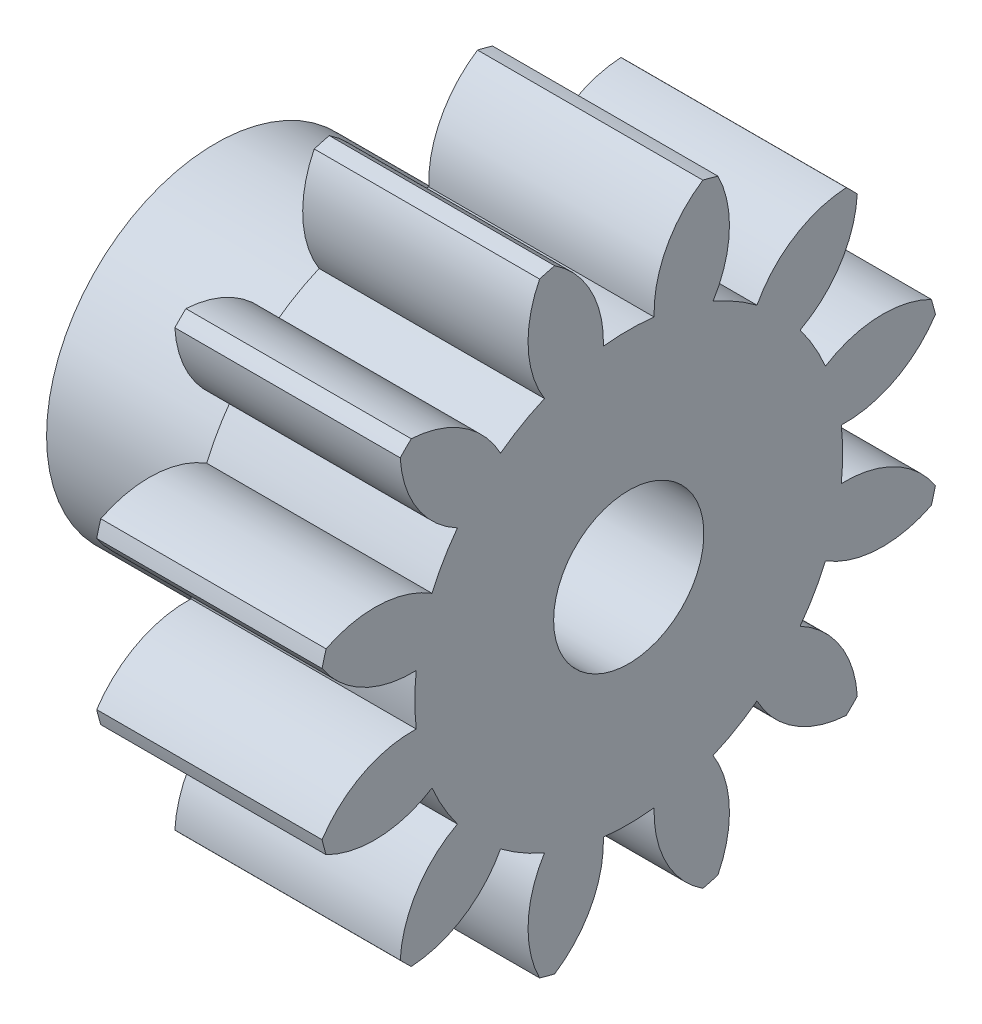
ISO-10303-21;
HEADER;
FILE_DESCRIPTION(('STEP AP214'),'2;1');
FILE_NAME('part.step','',(''),(''),'','','');
FILE_SCHEMA(('AUTOMOTIVE_DESIGN { 1 0 10303 214 1 1 1 1 }'));
ENDSEC;
DATA;
#1=APPLICATION_CONTEXT('core data for automotive mechanical design processes');
#2=APPLICATION_PROTOCOL_DEFINITION('international standard','automotive_design',2000,#1);
#3=PRODUCT_CONTEXT('',#1,'mechanical');
#4=PRODUCT('Part','Part','',(#3));
#5=PRODUCT_RELATED_PRODUCT_CATEGORY('part','',(#4));
#6=PRODUCT_DEFINITION_FORMATION('','',#4);
#7=PRODUCT_DEFINITION_CONTEXT('part definition',#1,'design');
#8=PRODUCT_DEFINITION('design','',#6,#7);
#9=PRODUCT_DEFINITION_SHAPE('','',#8);
#10=(LENGTH_UNIT() NAMED_UNIT(*) SI_UNIT(.MILLI.,.METRE.));
#11=(NAMED_UNIT(*) PLANE_ANGLE_UNIT() SI_UNIT($,.RADIAN.));
#12=(NAMED_UNIT(*) SI_UNIT($,.STERADIAN.) SOLID_ANGLE_UNIT());
#13=UNCERTAINTY_MEASURE_WITH_UNIT(LENGTH_MEASURE(1.E-05),#10,'distance_accuracy_value','');
#14=(GEOMETRIC_REPRESENTATION_CONTEXT(3) GLOBAL_UNCERTAINTY_ASSIGNED_CONTEXT((#13)) GLOBAL_UNIT_ASSIGNED_CONTEXT((#10,
#11,#12)) REPRESENTATION_CONTEXT('',''));
#15=CARTESIAN_POINT('',(0.,0.,0.));
#16=DIRECTION('',(0.,0.,1.));
#17=DIRECTION('',(1.,0.,0.));
#18=AXIS2_PLACEMENT_3D('',#15,#16,#17);
#19=CARTESIAN_POINT('',(3.,0.,0.));
#20=DIRECTION('',(-1.,0.,0.));
#21=DIRECTION('',(0.,0.,1.));
#22=AXIS2_PLACEMENT_3D('',#19,#20,#21);
#23=PLANE('',#22);
#24=CARTESIAN_POINT('',(3.,1.60468069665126,-2.97808123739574));
#25=DIRECTION('',(-1.,0.,0.));
#26=DIRECTION('',(0.,-0.499999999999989,-0.866025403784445));
#27=AXIS2_PLACEMENT_3D('',#24,#25,#26);
#28=CIRCLE('',#27,1.44);
#29=CARTESIAN_POINT('',(3.,2.28111325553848,-1.7068460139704));
#30=VERTEX_POINT('',#29);
#31=CARTESIAN_POINT('',(3.,3.0423147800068,-2.89556916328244));
#32=VERTEX_POINT('',#31);
#33=EDGE_CURVE('E351',#30,#32,#28,.T.);
#34=ORIENTED_EDGE('',*,*,#33,.F.);
#35=CARTESIAN_POINT('',(3.,0.,0.));
#36=DIRECTION('',(-1.,0.,0.));
#37=DIRECTION('',(0.,-0.499999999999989,-0.866025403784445));
#38=AXIS2_PLACEMENT_3D('',#35,#36,#37);
#39=CIRCLE('',#38,2.849);
#40=CARTESIAN_POINT('',(3.,2.61872863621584,-1.12207902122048));
#41=VERTEX_POINT('',#40);
#42=EDGE_CURVE('E350',#41,#30,#39,.T.);
#43=ORIENTED_EDGE('',*,*,#42,.F.);
#44=CARTESIAN_POINT('',(3.,3.38143435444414,0.0993463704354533));
#45=DIRECTION('',(-1.,0.,0.));
#46=DIRECTION('',(0.,-0.499999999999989,-0.866025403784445));
#47=AXIS2_PLACEMENT_3D('',#44,#45,#46);
#48=CIRCLE('',#47,1.44);
#49=CARTESIAN_POINT('',(3.,4.02879384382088,-1.18693730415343));
#50=VERTEX_POINT('',#49);
#51=EDGE_CURVE('E339',#50,#41,#48,.T.);
#52=ORIENTED_EDGE('',*,*,#51,.F.);
#53=CARTESIAN_POINT('',(3.,0.,0.));
#54=DIRECTION('',(-1.,0.,0.));
#55=DIRECTION('',(0.,0.,1.));
#56=AXIS2_PLACEMENT_3D('',#53,#54,#55);
#57=CIRCLE('',#56,4.2);
#58=CARTESIAN_POINT('',(3.,4.08250646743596,-0.986479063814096));
#59=VERTEX_POINT('',#58);
#60=EDGE_CURVE('E618',#59,#50,#57,.T.);
#61=ORIENTED_EDGE('',*,*,#60,.F.);
#62=CARTESIAN_POINT('',(3.,2.87873486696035,-1.77675365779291));
#63=DIRECTION('',(-1.,0.,0.));
#64=DIRECTION('',(0.,0.,-1.));
#65=AXIS2_PLACEMENT_3D('',#62,#63,#64);
#66=CIRCLE('',#65,1.44);
#67=CARTESIAN_POINT('',(3.,2.82892503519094,-0.337615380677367));
#68=VERTEX_POINT('',#67);
#69=EDGE_CURVE('E591',#68,#59,#66,.T.);
#70=ORIENTED_EDGE('',*,*,#69,.F.);
#71=CARTESIAN_POINT('',(3.,0.,0.));
#72=DIRECTION('',(-1.,0.,0.));
#73=DIRECTION('',(0.,0.,-1.));
#74=AXIS2_PLACEMENT_3D('',#71,#72,#73);
#75=CIRCLE('',#74,2.849);
#76=CARTESIAN_POINT('',(3.,2.82892503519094,0.337615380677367));
#77=VERTEX_POINT('',#76);
#78=EDGE_CURVE('E596',#77,#68,#75,.T.);
#79=ORIENTED_EDGE('',*,*,#78,.F.);
#80=CARTESIAN_POINT('',(3.,2.87873486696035,1.77675365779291));
#81=DIRECTION('',(-1.,0.,0.));
#82=DIRECTION('',(0.,0.,-1.));
#83=AXIS2_PLACEMENT_3D('',#80,#81,#82);
#84=CIRCLE('',#83,1.44);
#85=CARTESIAN_POINT('',(3.,4.08250646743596,0.986479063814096));
#86=VERTEX_POINT('',#85);
#87=EDGE_CURVE('E593',#86,#77,#84,.T.);
#88=ORIENTED_EDGE('',*,*,#87,.F.);
#89=CARTESIAN_POINT('',(3.,4.02879384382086,1.18693730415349));
#90=VERTEX_POINT('',#89);
#91=EDGE_CURVE('E616',#90,#86,#57,.T.);
#92=ORIENTED_EDGE('',*,*,#91,.F.);
#93=CARTESIAN_POINT('',(3.,3.38143435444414,-0.099346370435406));
#94=DIRECTION('',(-1.,0.,0.));
#95=DIRECTION('',(0.,0.500000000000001,-0.866025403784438));
#96=AXIS2_PLACEMENT_3D('',#93,#94,#95);
#97=CIRCLE('',#96,1.44);
#98=CARTESIAN_POINT('',(3.,2.61872863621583,1.12207902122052));
#99=VERTEX_POINT('',#98);
#100=EDGE_CURVE('E569',#99,#90,#97,.T.);
#101=ORIENTED_EDGE('',*,*,#100,.F.);
#102=CARTESIAN_POINT('',(3.,0.,0.));
#103=DIRECTION('',(-1.,0.,0.));
#104=DIRECTION('',(0.,0.500000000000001,-0.866025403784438));
#105=AXIS2_PLACEMENT_3D('',#102,#103,#104);
#106=CIRCLE('',#105,2.849);
#107=CARTESIAN_POINT('',(3.,2.28111325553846,1.70684601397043));
#108=VERTEX_POINT('',#107);
#109=EDGE_CURVE('E574',#108,#99,#106,.T.);
#110=ORIENTED_EDGE('',*,*,#109,.F.);
#111=CARTESIAN_POINT('',(3.,1.60468069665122,2.97808123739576));
#112=DIRECTION('',(-1.,0.,0.));
#113=DIRECTION('',(0.,0.500000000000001,-0.866025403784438));
#114=AXIS2_PLACEMENT_3D('',#111,#112,#113);
#115=CIRCLE('',#114,1.44);
#116=CARTESIAN_POINT('',(3.,3.04231478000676,2.89556916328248));
#117=VERTEX_POINT('',#116);
#118=EDGE_CURVE('E571',#117,#108,#115,.T.);
#119=ORIENTED_EDGE('',*,*,#118,.F.);
#120=CARTESIAN_POINT('',(3.,2.89556916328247,3.04231478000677));
#121=VERTEX_POINT('',#120);
#122=EDGE_CURVE('E681',#121,#117,#57,.T.);
#123=ORIENTED_EDGE('',*,*,#122,.F.);
#124=CARTESIAN_POINT('',(3.,2.97808123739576,1.60468069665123));
#125=DIRECTION('',(-1.,0.,0.));
#126=DIRECTION('',(0.,0.86602540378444,-0.499999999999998));
#127=AXIS2_PLACEMENT_3D('',#124,#125,#126);
#128=CIRCLE('',#127,1.44);
#129=CARTESIAN_POINT('',(3.,1.70684601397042,2.28111325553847));
#130=VERTEX_POINT('',#129);
#131=EDGE_CURVE('E547',#130,#121,#128,.T.);
#132=ORIENTED_EDGE('',*,*,#131,.F.);
#133=CARTESIAN_POINT('',(3.,0.,0.));
#134=DIRECTION('',(-1.,0.,0.));
#135=DIRECTION('',(0.,0.86602540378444,-0.499999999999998));
#136=AXIS2_PLACEMENT_3D('',#133,#134,#135);
#137=CIRCLE('',#136,2.849);
#138=CARTESIAN_POINT('',(3.,1.12207902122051,2.61872863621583));
#139=VERTEX_POINT('',#138);
#140=EDGE_CURVE('E552',#139,#130,#137,.T.);
#141=ORIENTED_EDGE('',*,*,#140,.F.);
#142=CARTESIAN_POINT('',(3.,-0.099346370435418,3.38143435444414));
#143=DIRECTION('',(-1.,0.,0.));
#144=DIRECTION('',(0.,0.86602540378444,-0.499999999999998));
#145=AXIS2_PLACEMENT_3D('',#142,#143,#144);
#146=CIRCLE('',#145,1.44);
#147=CARTESIAN_POINT('',(3.,1.18693730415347,4.02879384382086));
#148=VERTEX_POINT('',#147);
#149=EDGE_CURVE('E549',#148,#139,#146,.T.);
#150=ORIENTED_EDGE('',*,*,#149,.F.);
#151=CARTESIAN_POINT('',(3.,0.986479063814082,4.08250646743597));
#152=VERTEX_POINT('',#151);
#153=EDGE_CURVE('E682',#152,#148,#57,.T.);
#154=ORIENTED_EDGE('',*,*,#153,.F.);
#155=CARTESIAN_POINT('',(3.,1.7767536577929,2.87873486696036));
#156=DIRECTION('',(-1.,0.,0.));
#157=DIRECTION('',(0.,1.,0.));
#158=AXIS2_PLACEMENT_3D('',#155,#156,#157);
#159=CIRCLE('',#158,1.44);
#160=CARTESIAN_POINT('',(3.,0.337615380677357,2.82892503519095));
#161=VERTEX_POINT('',#160);
#162=EDGE_CURVE('E525',#161,#152,#159,.T.);
#163=ORIENTED_EDGE('',*,*,#162,.F.);
#164=CARTESIAN_POINT('',(3.,0.,0.));
#165=DIRECTION('',(-1.,0.,0.));
#166=DIRECTION('',(0.,1.,0.));
#167=AXIS2_PLACEMENT_3D('',#164,#165,#166);
#168=CIRCLE('',#167,2.849);
#169=CARTESIAN_POINT('',(3.,-0.337615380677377,2.82892503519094));
#170=VERTEX_POINT('',#169);
#171=EDGE_CURVE('E530',#170,#161,#168,.T.);
#172=ORIENTED_EDGE('',*,*,#171,.F.);
#173=CARTESIAN_POINT('',(3.,-1.77675365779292,2.87873486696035));
#174=DIRECTION('',(-1.,0.,0.));
#175=DIRECTION('',(0.,1.,0.));
#176=AXIS2_PLACEMENT_3D('',#173,#174,#175);
#177=CIRCLE('',#176,1.44);
#178=CARTESIAN_POINT('',(3.,-0.98647906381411,4.08250646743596));
#179=VERTEX_POINT('',#178);
#180=EDGE_CURVE('E527',#179,#170,#177,.T.);
#181=ORIENTED_EDGE('',*,*,#180,.F.);
#182=CARTESIAN_POINT('',(3.,-1.1869373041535,4.02879384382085));
#183=VERTEX_POINT('',#182);
#184=EDGE_CURVE('E687',#183,#179,#57,.T.);
#185=ORIENTED_EDGE('',*,*,#184,.F.);
#186=CARTESIAN_POINT('',(3.,0.0993463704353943,3.38143435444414));
#187=DIRECTION('',(-1.,0.,0.));
#188=DIRECTION('',(0.,0.866025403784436,0.500000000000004));
#189=AXIS2_PLACEMENT_3D('',#186,#187,#188);
#190=CIRCLE('',#189,1.44);
#191=CARTESIAN_POINT('',(3.,-1.12207902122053,2.61872863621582));
#192=VERTEX_POINT('',#191);
#193=EDGE_CURVE('E503',#192,#183,#190,.T.);
#194=ORIENTED_EDGE('',*,*,#193,.F.);
#195=CARTESIAN_POINT('',(3.,0.,0.));
#196=DIRECTION('',(-1.,0.,0.));
#197=DIRECTION('',(0.,0.866025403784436,0.500000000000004));
#198=AXIS2_PLACEMENT_3D('',#195,#196,#197);
#199=CIRCLE('',#198,2.849);
#200=CARTESIAN_POINT('',(3.,-1.70684601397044,2.28111325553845));
#201=VERTEX_POINT('',#200);
#202=EDGE_CURVE('E508',#201,#192,#199,.T.);
#203=ORIENTED_EDGE('',*,*,#202,.F.);
#204=CARTESIAN_POINT('',(3.,-2.97808123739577,1.60468069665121));
#205=DIRECTION('',(-1.,0.,0.));
#206=DIRECTION('',(0.,0.866025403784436,0.500000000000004));
#207=AXIS2_PLACEMENT_3D('',#204,#205,#206);
#208=CIRCLE('',#207,1.44);
#209=CARTESIAN_POINT('',(3.,-2.89556916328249,3.04231478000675));
#210=VERTEX_POINT('',#209);
#211=EDGE_CURVE('E505',#210,#201,#208,.T.);
#212=ORIENTED_EDGE('',*,*,#211,.F.);
#213=CARTESIAN_POINT('',(3.,-3.04231478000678,2.89556916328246));
#214=VERTEX_POINT('',#213);
#215=EDGE_CURVE('E692',#214,#210,#57,.T.);
#216=ORIENTED_EDGE('',*,*,#215,.F.);
#217=CARTESIAN_POINT('',(3.,-1.60468069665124,2.97808123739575));
#218=DIRECTION('',(-1.,0.,0.));
#219=DIRECTION('',(0.,0.499999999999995,0.866025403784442));
#220=AXIS2_PLACEMENT_3D('',#217,#218,#219);
#221=CIRCLE('',#220,1.44);
#222=CARTESIAN_POINT('',(3.,-2.28111325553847,1.70684601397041));
#223=VERTEX_POINT('',#222);
#224=EDGE_CURVE('E481',#223,#214,#221,.T.);
#225=ORIENTED_EDGE('',*,*,#224,.F.);
#226=CARTESIAN_POINT('',(3.,0.,0.));
#227=DIRECTION('',(-1.,0.,0.));
#228=DIRECTION('',(0.,0.499999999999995,0.866025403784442));
#229=AXIS2_PLACEMENT_3D('',#226,#227,#228);
#230=CIRCLE('',#229,2.849);
#231=CARTESIAN_POINT('',(3.,-2.61872863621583,1.1220790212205));
#232=VERTEX_POINT('',#231);
#233=EDGE_CURVE('E486',#232,#223,#230,.T.);
#234=ORIENTED_EDGE('',*,*,#233,.F.);
#235=CARTESIAN_POINT('',(3.,-3.38143435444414,-0.0993463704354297));
#236=DIRECTION('',(-1.,0.,0.));
#237=DIRECTION('',(0.,0.499999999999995,0.866025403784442));
#238=AXIS2_PLACEMENT_3D('',#235,#236,#237);
#239=CIRCLE('',#238,1.44);
#240=CARTESIAN_POINT('',(3.,-4.02879384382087,1.18693730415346));
#241=VERTEX_POINT('',#240);
#242=EDGE_CURVE('E483',#241,#232,#239,.T.);
#243=ORIENTED_EDGE('',*,*,#242,.F.);
#244=CARTESIAN_POINT('',(3.,-4.08250646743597,0.986479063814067));
#245=VERTEX_POINT('',#244);
#246=EDGE_CURVE('E697',#245,#241,#57,.T.);
#247=ORIENTED_EDGE('',*,*,#246,.F.);
#248=CARTESIAN_POINT('',(3.,-2.87873486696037,1.77675365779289));
#249=DIRECTION('',(-1.,0.,0.));
#250=DIRECTION('',(0.,0.,1.));
#251=AXIS2_PLACEMENT_3D('',#248,#249,#250);
#252=CIRCLE('',#251,1.44);
#253=CARTESIAN_POINT('',(3.,-2.82892503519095,0.337615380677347));
#254=VERTEX_POINT('',#253);
#255=EDGE_CURVE('E459',#254,#245,#252,.T.);
#256=ORIENTED_EDGE('',*,*,#255,.F.);
#257=CARTESIAN_POINT('',(3.,0.,0.));
#258=DIRECTION('',(-1.,0.,0.));
#259=DIRECTION('',(0.,0.,1.));
#260=AXIS2_PLACEMENT_3D('',#257,#258,#259);
#261=CIRCLE('',#260,2.849);
#262=CARTESIAN_POINT('',(3.,-2.82892503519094,-0.337615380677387));
#263=VERTEX_POINT('',#262);
#264=EDGE_CURVE('E464',#263,#254,#261,.T.);
#265=ORIENTED_EDGE('',*,*,#264,.F.);
#266=CARTESIAN_POINT('',(3.,-2.87873486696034,-1.77675365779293));
#267=DIRECTION('',(-1.,0.,0.));
#268=DIRECTION('',(0.,0.,1.));
#269=AXIS2_PLACEMENT_3D('',#266,#267,#268);
#270=CIRCLE('',#269,1.44);
#271=CARTESIAN_POINT('',(3.,-4.08250646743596,-0.986479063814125));
#272=VERTEX_POINT('',#271);
#273=EDGE_CURVE('E461',#272,#263,#270,.T.);
#274=ORIENTED_EDGE('',*,*,#273,.F.);
#275=CARTESIAN_POINT('',(3.,-4.02879384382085,-1.18693730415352));
#276=VERTEX_POINT('',#275);
#277=EDGE_CURVE('E702',#276,#272,#57,.T.);
#278=ORIENTED_EDGE('',*,*,#277,.F.);
#279=CARTESIAN_POINT('',(3.,-3.38143435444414,0.0993463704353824));
#280=DIRECTION('',(-1.,0.,0.));
#281=DIRECTION('',(0.,-0.500000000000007,0.866025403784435));
#282=AXIS2_PLACEMENT_3D('',#279,#280,#281);
#283=CIRCLE('',#282,1.44);
#284=CARTESIAN_POINT('',(3.,-2.61872863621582,-1.12207902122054));
#285=VERTEX_POINT('',#284);
#286=EDGE_CURVE('E437',#285,#276,#283,.T.);
#287=ORIENTED_EDGE('',*,*,#286,.F.);
#288=CARTESIAN_POINT('',(3.,0.,0.));
#289=DIRECTION('',(-1.,0.,0.));
#290=DIRECTION('',(0.,-0.500000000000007,0.866025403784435));
#291=AXIS2_PLACEMENT_3D('',#288,#289,#290);
#292=CIRCLE('',#291,2.849);
#293=CARTESIAN_POINT('',(3.,-2.28111325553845,-1.70684601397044));
#294=VERTEX_POINT('',#293);
#295=EDGE_CURVE('E442',#294,#285,#292,.T.);
#296=ORIENTED_EDGE('',*,*,#295,.F.);
#297=CARTESIAN_POINT('',(3.,-1.6046806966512,-2.97808123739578));
#298=DIRECTION('',(-1.,0.,0.));
#299=DIRECTION('',(0.,-0.500000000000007,0.866025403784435));
#300=AXIS2_PLACEMENT_3D('',#297,#298,#299);
#301=CIRCLE('',#300,1.44);
#302=CARTESIAN_POINT('',(3.,-3.04231478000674,-2.8955691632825));
#303=VERTEX_POINT('',#302);
#304=EDGE_CURVE('E439',#303,#294,#301,.T.);
#305=ORIENTED_EDGE('',*,*,#304,.F.);
#306=CARTESIAN_POINT('',(3.,-2.89556916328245,-3.04231478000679));
#307=VERTEX_POINT('',#306);
#308=EDGE_CURVE('E707',#307,#303,#57,.T.);
#309=ORIENTED_EDGE('',*,*,#308,.F.);
#310=CARTESIAN_POINT('',(3.,-2.97808123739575,-1.60468069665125));
#311=DIRECTION('',(-1.,0.,0.));
#312=DIRECTION('',(0.,-0.866025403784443,0.499999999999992));
#313=AXIS2_PLACEMENT_3D('',#310,#311,#312);
#314=CIRCLE('',#313,1.44);
#315=CARTESIAN_POINT('',(3.,-1.7068460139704,-2.28111325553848));
#316=VERTEX_POINT('',#315);
#317=EDGE_CURVE('E415',#316,#307,#314,.T.);
#318=ORIENTED_EDGE('',*,*,#317,.F.);
#319=CARTESIAN_POINT('',(3.,0.,0.));
#320=DIRECTION('',(-1.,0.,0.));
#321=DIRECTION('',(0.,-0.866025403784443,0.499999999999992));
#322=AXIS2_PLACEMENT_3D('',#319,#320,#321);
#323=CIRCLE('',#322,2.849);
#324=CARTESIAN_POINT('',(3.,-1.12207902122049,-2.61872863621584));
#325=VERTEX_POINT('',#324);
#326=EDGE_CURVE('E420',#325,#316,#323,.T.);
#327=ORIENTED_EDGE('',*,*,#326,.F.);
#328=CARTESIAN_POINT('',(3.,0.0993463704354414,-3.38143435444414));
#329=DIRECTION('',(-1.,0.,0.));
#330=DIRECTION('',(0.,-0.866025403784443,0.499999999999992));
#331=AXIS2_PLACEMENT_3D('',#328,#329,#330);
#332=CIRCLE('',#331,1.44);
#333=CARTESIAN_POINT('',(3.,-1.18693730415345,-4.02879384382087));
#334=VERTEX_POINT('',#333);
#335=EDGE_CURVE('E417',#334,#325,#332,.T.);
#336=ORIENTED_EDGE('',*,*,#335,.F.);
#337=CARTESIAN_POINT('',(3.,-0.986479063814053,-4.08250646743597));
#338=VERTEX_POINT('',#337);
#339=EDGE_CURVE('E712',#338,#334,#57,.T.);
#340=ORIENTED_EDGE('',*,*,#339,.F.);
#341=CARTESIAN_POINT('',(3.,-1.77675365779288,-2.87873486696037));
#342=DIRECTION('',(-1.,0.,0.));
#343=DIRECTION('',(0.,-1.,0.));
#344=AXIS2_PLACEMENT_3D('',#341,#342,#343);
#345=CIRCLE('',#344,1.44);
#346=CARTESIAN_POINT('',(3.,-0.337615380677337,-2.82892503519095));
#347=VERTEX_POINT('',#346);
#348=EDGE_CURVE('E393',#347,#338,#345,.T.);
#349=ORIENTED_EDGE('',*,*,#348,.F.);
#350=CARTESIAN_POINT('',(3.,0.,0.));
#351=DIRECTION('',(-1.,0.,0.));
#352=DIRECTION('',(0.,-1.,0.));
#353=AXIS2_PLACEMENT_3D('',#350,#351,#352);
#354=CIRCLE('',#353,2.849);
#355=CARTESIAN_POINT('',(3.,0.337615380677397,-2.82892503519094));
#356=VERTEX_POINT('',#355);
#357=EDGE_CURVE('E398',#356,#347,#354,.T.);
#358=ORIENTED_EDGE('',*,*,#357,.F.);
#359=CARTESIAN_POINT('',(3.,1.77675365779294,-2.87873486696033));
#360=DIRECTION('',(-1.,0.,0.));
#361=DIRECTION('',(0.,-1.,0.));
#362=AXIS2_PLACEMENT_3D('',#359,#360,#361);
#363=CIRCLE('',#362,1.44);
#364=CARTESIAN_POINT('',(3.,0.986479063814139,-4.08250646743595));
#365=VERTEX_POINT('',#364);
#366=EDGE_CURVE('E395',#365,#356,#363,.T.);
#367=ORIENTED_EDGE('',*,*,#366,.F.);
#368=CARTESIAN_POINT('',(3.,1.18693730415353,-4.02879384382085));
#369=VERTEX_POINT('',#368);
#370=EDGE_CURVE('E717',#369,#365,#57,.T.);
#371=ORIENTED_EDGE('',*,*,#370,.F.);
#372=CARTESIAN_POINT('',(3.,-0.0993463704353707,-3.38143435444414));
#373=DIRECTION('',(-1.,0.,0.));
#374=DIRECTION('',(0.,-0.866025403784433,-0.50000000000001));
#375=AXIS2_PLACEMENT_3D('',#372,#373,#374);
#376=CIRCLE('',#375,1.44);
#377=CARTESIAN_POINT('',(3.,1.12207902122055,-2.61872863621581));
#378=VERTEX_POINT('',#377);
#379=EDGE_CURVE('E373',#378,#369,#376,.T.);
#380=ORIENTED_EDGE('',*,*,#379,.F.);
#381=CARTESIAN_POINT('',(3.,0.,0.));
#382=DIRECTION('',(-1.,0.,0.));
#383=DIRECTION('',(0.,-0.866025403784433,-0.50000000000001));
#384=AXIS2_PLACEMENT_3D('',#381,#382,#383);
#385=CIRCLE('',#384,2.849);
#386=CARTESIAN_POINT('',(3.,1.70684601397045,-2.28111325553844));
#387=VERTEX_POINT('',#386);
#388=EDGE_CURVE('E378',#387,#378,#385,.T.);
#389=ORIENTED_EDGE('',*,*,#388,.F.);
#390=CARTESIAN_POINT('',(3.,2.97808123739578,-1.60468069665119));
#391=DIRECTION('',(-1.,0.,0.));
#392=DIRECTION('',(0.,-0.866025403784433,-0.50000000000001));
#393=AXIS2_PLACEMENT_3D('',#390,#391,#392);
#394=CIRCLE('',#393,1.44);
#395=CARTESIAN_POINT('',(3.,2.89556916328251,-3.04231478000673));
#396=VERTEX_POINT('',#395);
#397=EDGE_CURVE('E375',#396,#387,#394,.T.);
#398=ORIENTED_EDGE('',*,*,#397,.F.);
#399=EDGE_CURVE('E621',#32,#396,#57,.T.);
#400=ORIENTED_EDGE('',*,*,#399,.F.);
#401=EDGE_LOOP('',(#34,#43,#52,#61,#70,#79,#88,#92,#101,#110,#119,#123,#132,#141,#150,#154,#163,
#172,#181,#185,#194,#203,#212,#216,#225,#234,#243,#247,#256,#265,#274,#278,#287,#296,#305,#309,
#318,#327,#336,#340,#349,#358,#367,#371,#380,#389,#398,#400));
#402=FACE_BOUND('',#401,.T.);
#403=CARTESIAN_POINT('',(3.,0.,0.));
#404=DIRECTION('',(-1.,0.,0.));
#405=DIRECTION('',(0.,0.,1.));
#406=AXIS2_PLACEMENT_3D('',#403,#404,#405);
#407=CIRCLE('',#406,1.);
#408=CARTESIAN_POINT('',(3.,0.,1.));
#409=VERTEX_POINT('',#408);
#410=EDGE_CURVE('E1310',#409,#409,#407,.F.);
#411=ORIENTED_EDGE('',*,*,#410,.F.);
#412=EDGE_LOOP('',(#411));
#413=FACE_BOUND('',#412,.T.);
#414=ADVANCED_FACE('F33',(#402,#413),#23,.F.);
#415=CARTESIAN_POINT('',(-2.5,0.,0.));
#416=DIRECTION('',(-1.,0.,0.));
#417=DIRECTION('',(0.,0.,1.));
#418=AXIS2_PLACEMENT_3D('',#415,#416,#417);
#419=PLANE('',#418);
#420=CARTESIAN_POINT('',(-2.5,0.,0.));
#421=DIRECTION('',(-1.,0.,0.));
#422=DIRECTION('',(0.,0.,1.));
#423=AXIS2_PLACEMENT_3D('',#420,#421,#422);
#424=CIRCLE('',#423,2.25);
#425=CARTESIAN_POINT('',(-2.5,0.,2.25));
#426=VERTEX_POINT('',#425);
#427=EDGE_CURVE('E368',#426,#426,#424,.T.);
#428=ORIENTED_EDGE('',*,*,#427,.T.);
#429=EDGE_LOOP('',(#428));
#430=FACE_BOUND('',#429,.T.);
#431=CARTESIAN_POINT('',(-2.5,0.,0.));
#432=DIRECTION('',(-1.,0.,0.));
#433=DIRECTION('',(0.,0.,1.));
#434=AXIS2_PLACEMENT_3D('',#431,#432,#433);
#435=CIRCLE('',#434,1.);
#436=CARTESIAN_POINT('',(-2.5,0.,1.));
#437=VERTEX_POINT('',#436);
#438=EDGE_CURVE('E36',#437,#437,#435,.F.);
#439=ORIENTED_EDGE('',*,*,#438,.T.);
#440=EDGE_LOOP('',(#439));
#441=FACE_BOUND('',#440,.T.);
#442=ADVANCED_FACE('F894',(#430,#441),#419,.T.);
#443=CARTESIAN_POINT('',(0.,0.,0.));
#444=DIRECTION('',(1.,0.,0.));
#445=DIRECTION('',(0.,0.,-1.));
#446=AXIS2_PLACEMENT_3D('',#443,#444,#445);
#447=PLANE('',#446);
#448=CARTESIAN_POINT('',(0.,1.60468069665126,-2.97808123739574));
#449=DIRECTION('',(-1.,0.,0.));
#450=DIRECTION('',(0.,-0.499999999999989,-0.866025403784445));
#451=AXIS2_PLACEMENT_3D('',#448,#449,#450);
#452=CIRCLE('',#451,1.44);
#453=CARTESIAN_POINT('',(0.,2.28111325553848,-1.7068460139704));
#454=VERTEX_POINT('',#453);
#455=CARTESIAN_POINT('',(0.,3.0423147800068,-2.89556916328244));
#456=VERTEX_POINT('',#455);
#457=EDGE_CURVE('E48',#454,#456,#452,.T.);
#458=ORIENTED_EDGE('',*,*,#457,.T.);
#459=CARTESIAN_POINT('',(0.,0.,0.));
#460=DIRECTION('',(-1.,0.,0.));
#461=DIRECTION('',(0.,0.,1.));
#462=AXIS2_PLACEMENT_3D('',#459,#460,#461);
#463=CIRCLE('',#462,4.2);
#464=CARTESIAN_POINT('',(0.,2.89556916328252,-3.04231478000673));
#465=VERTEX_POINT('',#464);
#466=EDGE_CURVE('E617',#456,#465,#463,.T.);
#467=ORIENTED_EDGE('',*,*,#466,.T.);
#468=CARTESIAN_POINT('',(0.,2.97808123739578,-1.60468069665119));
#469=DIRECTION('',(1.,0.,0.));
#470=DIRECTION('',(0.,0.,-1.));
#471=AXIS2_PLACEMENT_3D('',#468,#469,#470);
#472=CIRCLE('',#471,1.44);
#473=CARTESIAN_POINT('',(0.,1.70684601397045,-2.28111325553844));
#474=VERTEX_POINT('',#473);
#475=EDGE_CURVE('E651',#474,#465,#472,.T.);
#476=ORIENTED_EDGE('',*,*,#475,.F.);
#477=CARTESIAN_POINT('',(0.,0.,0.));
#478=DIRECTION('',(-1.,0.,0.));
#479=DIRECTION('',(0.,-0.866025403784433,-0.50000000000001));
#480=AXIS2_PLACEMENT_3D('',#477,#478,#479);
#481=CIRCLE('',#480,2.849);
#482=CARTESIAN_POINT('',(0.,1.12207902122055,-2.61872863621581));
#483=VERTEX_POINT('',#482);
#484=EDGE_CURVE('E376',#474,#483,#481,.T.);
#485=ORIENTED_EDGE('',*,*,#484,.T.);
#486=CARTESIAN_POINT('',(0.,-0.0993463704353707,-3.38143435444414));
#487=DIRECTION('',(-1.,0.,0.));
#488=DIRECTION('',(0.,-0.866025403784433,-0.50000000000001));
#489=AXIS2_PLACEMENT_3D('',#486,#487,#488);
#490=CIRCLE('',#489,1.44);
#491=CARTESIAN_POINT('',(0.,1.18693730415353,-4.02879384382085));
#492=VERTEX_POINT('',#491);
#493=EDGE_CURVE('E56',#483,#492,#490,.T.);
#494=ORIENTED_EDGE('',*,*,#493,.T.);
#495=CARTESIAN_POINT('',(0.,0.98647906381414,-4.08250646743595));
#496=VERTEX_POINT('',#495);
#497=EDGE_CURVE('E744',#492,#496,#463,.T.);
#498=ORIENTED_EDGE('',*,*,#497,.T.);
#499=CARTESIAN_POINT('',(0.,1.77675365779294,-2.87873486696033));
#500=DIRECTION('',(1.,0.,0.));
#501=DIRECTION('',(0.,0.,-1.));
#502=AXIS2_PLACEMENT_3D('',#499,#500,#501);
#503=CIRCLE('',#502,1.44);
#504=CARTESIAN_POINT('',(0.,0.337615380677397,-2.82892503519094));
#505=VERTEX_POINT('',#504);
#506=EDGE_CURVE('E648',#505,#496,#503,.T.);
#507=ORIENTED_EDGE('',*,*,#506,.F.);
#508=CARTESIAN_POINT('',(0.,0.,0.));
#509=DIRECTION('',(-1.,0.,0.));
#510=DIRECTION('',(0.,-1.,0.));
#511=AXIS2_PLACEMENT_3D('',#508,#509,#510);
#512=CIRCLE('',#511,2.849);
#513=CARTESIAN_POINT('',(0.,-0.337615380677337,-2.82892503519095));
#514=VERTEX_POINT('',#513);
#515=EDGE_CURVE('E396',#505,#514,#512,.T.);
#516=ORIENTED_EDGE('',*,*,#515,.T.);
#517=CARTESIAN_POINT('',(0.,-1.77675365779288,-2.87873486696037));
#518=DIRECTION('',(-1.,0.,0.));
#519=DIRECTION('',(0.,-1.,0.));
#520=AXIS2_PLACEMENT_3D('',#517,#518,#519);
#521=CIRCLE('',#520,1.44);
#522=CARTESIAN_POINT('',(0.,-0.986479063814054,-4.08250646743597));
#523=VERTEX_POINT('',#522);
#524=EDGE_CURVE('E392',#514,#523,#521,.T.);
#525=ORIENTED_EDGE('',*,*,#524,.T.);
#526=CARTESIAN_POINT('',(0.,-1.18693730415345,-4.02879384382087));
#527=VERTEX_POINT('',#526);
#528=EDGE_CURVE('E756',#523,#527,#463,.T.);
#529=ORIENTED_EDGE('',*,*,#528,.T.);
#530=CARTESIAN_POINT('',(0.,0.0993463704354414,-3.38143435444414));
#531=DIRECTION('',(1.,0.,0.));
#532=DIRECTION('',(0.,0.,-1.));
#533=AXIS2_PLACEMENT_3D('',#530,#531,#532);
#534=CIRCLE('',#533,1.44);
#535=CARTESIAN_POINT('',(0.,-1.12207902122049,-2.61872863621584));
#536=VERTEX_POINT('',#535);
#537=EDGE_CURVE('E645',#536,#527,#534,.T.);
#538=ORIENTED_EDGE('',*,*,#537,.F.);
#539=CARTESIAN_POINT('',(0.,0.,0.));
#540=DIRECTION('',(-1.,0.,0.));
#541=DIRECTION('',(0.,-0.866025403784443,0.499999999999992));
#542=AXIS2_PLACEMENT_3D('',#539,#540,#541);
#543=CIRCLE('',#542,2.849);
#544=CARTESIAN_POINT('',(0.,-1.7068460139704,-2.28111325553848));
#545=VERTEX_POINT('',#544);
#546=EDGE_CURVE('E418',#536,#545,#543,.T.);
#547=ORIENTED_EDGE('',*,*,#546,.T.);
#548=CARTESIAN_POINT('',(0.,-2.97808123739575,-1.60468069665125));
#549=DIRECTION('',(-1.,0.,0.));
#550=DIRECTION('',(0.,-0.866025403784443,0.499999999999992));
#551=AXIS2_PLACEMENT_3D('',#548,#549,#550);
#552=CIRCLE('',#551,1.44);
#553=CARTESIAN_POINT('',(0.,-2.89556916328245,-3.04231478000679));
#554=VERTEX_POINT('',#553);
#555=EDGE_CURVE('E414',#545,#554,#552,.T.);
#556=ORIENTED_EDGE('',*,*,#555,.T.);
#557=CARTESIAN_POINT('',(0.,-3.04231478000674,-2.8955691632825));
#558=VERTEX_POINT('',#557);
#559=EDGE_CURVE('E757',#554,#558,#463,.T.);
#560=ORIENTED_EDGE('',*,*,#559,.T.);
#561=CARTESIAN_POINT('',(0.,-1.6046806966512,-2.97808123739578));
#562=DIRECTION('',(1.,0.,0.));
#563=DIRECTION('',(0.,0.,-1.));
#564=AXIS2_PLACEMENT_3D('',#561,#562,#563);
#565=CIRCLE('',#564,1.44);
#566=CARTESIAN_POINT('',(0.,-2.28111325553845,-1.70684601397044));
#567=VERTEX_POINT('',#566);
#568=EDGE_CURVE('E642',#567,#558,#565,.T.);
#569=ORIENTED_EDGE('',*,*,#568,.F.);
#570=CARTESIAN_POINT('',(0.,0.,0.));
#571=DIRECTION('',(-1.,0.,0.));
#572=DIRECTION('',(0.,-0.500000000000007,0.866025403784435));
#573=AXIS2_PLACEMENT_3D('',#570,#571,#572);
#574=CIRCLE('',#573,2.849);
#575=CARTESIAN_POINT('',(0.,-2.61872863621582,-1.12207902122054));
#576=VERTEX_POINT('',#575);
#577=EDGE_CURVE('E440',#567,#576,#574,.T.);
#578=ORIENTED_EDGE('',*,*,#577,.T.);
#579=CARTESIAN_POINT('',(0.,-3.38143435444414,0.0993463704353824));
#580=DIRECTION('',(-1.,0.,0.));
#581=DIRECTION('',(0.,-0.500000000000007,0.866025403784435));
#582=AXIS2_PLACEMENT_3D('',#579,#580,#581);
#583=CIRCLE('',#582,1.44);
#584=CARTESIAN_POINT('',(0.,-4.02879384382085,-1.18693730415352));
#585=VERTEX_POINT('',#584);
#586=EDGE_CURVE('E436',#576,#585,#583,.T.);
#587=ORIENTED_EDGE('',*,*,#586,.T.);
#588=CARTESIAN_POINT('',(0.,-4.08250646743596,-0.986479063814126));
#589=VERTEX_POINT('',#588);
#590=EDGE_CURVE('E760',#585,#589,#463,.T.);
#591=ORIENTED_EDGE('',*,*,#590,.T.);
#592=CARTESIAN_POINT('',(0.,-2.87873486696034,-1.77675365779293));
#593=DIRECTION('',(1.,0.,0.));
#594=DIRECTION('',(0.,0.,-1.));
#595=AXIS2_PLACEMENT_3D('',#592,#593,#594);
#596=CIRCLE('',#595,1.44);
#597=CARTESIAN_POINT('',(0.,-2.82892503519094,-0.337615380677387));
#598=VERTEX_POINT('',#597);
#599=EDGE_CURVE('E639',#598,#589,#596,.T.);
#600=ORIENTED_EDGE('',*,*,#599,.F.);
#601=CARTESIAN_POINT('',(0.,0.,0.));
#602=DIRECTION('',(-1.,0.,0.));
#603=DIRECTION('',(0.,0.,1.));
#604=AXIS2_PLACEMENT_3D('',#601,#602,#603);
#605=CIRCLE('',#604,2.849);
#606=CARTESIAN_POINT('',(0.,-2.82892503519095,0.337615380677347));
#607=VERTEX_POINT('',#606);
#608=EDGE_CURVE('E462',#598,#607,#605,.T.);
#609=ORIENTED_EDGE('',*,*,#608,.T.);
#610=CARTESIAN_POINT('',(0.,-2.87873486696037,1.77675365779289));
#611=DIRECTION('',(-1.,0.,0.));
#612=DIRECTION('',(0.,0.,1.));
#613=AXIS2_PLACEMENT_3D('',#610,#611,#612);
#614=CIRCLE('',#613,1.44);
#615=CARTESIAN_POINT('',(0.,-4.08250646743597,0.986479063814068));
#616=VERTEX_POINT('',#615);
#617=EDGE_CURVE('E458',#607,#616,#614,.T.);
#618=ORIENTED_EDGE('',*,*,#617,.T.);
#619=CARTESIAN_POINT('',(0.,-4.02879384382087,1.18693730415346));
#620=VERTEX_POINT('',#619);
#621=EDGE_CURVE('E763',#616,#620,#463,.T.);
#622=ORIENTED_EDGE('',*,*,#621,.T.);
#623=CARTESIAN_POINT('',(0.,-3.38143435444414,-0.0993463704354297));
#624=DIRECTION('',(1.,0.,0.));
#625=DIRECTION('',(0.,0.,-1.));
#626=AXIS2_PLACEMENT_3D('',#623,#624,#625);
#627=CIRCLE('',#626,1.44);
#628=CARTESIAN_POINT('',(0.,-2.61872863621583,1.1220790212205));
#629=VERTEX_POINT('',#628);
#630=EDGE_CURVE('E636',#629,#620,#627,.T.);
#631=ORIENTED_EDGE('',*,*,#630,.F.);
#632=CARTESIAN_POINT('',(0.,0.,0.));
#633=DIRECTION('',(-1.,0.,0.));
#634=DIRECTION('',(0.,0.499999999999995,0.866025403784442));
#635=AXIS2_PLACEMENT_3D('',#632,#633,#634);
#636=CIRCLE('',#635,2.849);
#637=CARTESIAN_POINT('',(0.,-2.28111325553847,1.70684601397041));
#638=VERTEX_POINT('',#637);
#639=EDGE_CURVE('E484',#629,#638,#636,.T.);
#640=ORIENTED_EDGE('',*,*,#639,.T.);
#641=CARTESIAN_POINT('',(0.,-1.60468069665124,2.97808123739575));
#642=DIRECTION('',(-1.,0.,0.));
#643=DIRECTION('',(0.,0.499999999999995,0.866025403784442));
#644=AXIS2_PLACEMENT_3D('',#641,#642,#643);
#645=CIRCLE('',#644,1.44);
#646=CARTESIAN_POINT('',(0.,-3.04231478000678,2.89556916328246));
#647=VERTEX_POINT('',#646);
#648=EDGE_CURVE('E480',#638,#647,#645,.T.);
#649=ORIENTED_EDGE('',*,*,#648,.T.);
#650=CARTESIAN_POINT('',(0.,-2.8955691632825,3.04231478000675));
#651=VERTEX_POINT('',#650);
#652=EDGE_CURVE('E766',#647,#651,#463,.T.);
#653=ORIENTED_EDGE('',*,*,#652,.T.);
#654=CARTESIAN_POINT('',(0.,-2.97808123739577,1.60468069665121));
#655=DIRECTION('',(1.,0.,0.));
#656=DIRECTION('',(0.,0.,-1.));
#657=AXIS2_PLACEMENT_3D('',#654,#655,#656);
#658=CIRCLE('',#657,1.44);
#659=CARTESIAN_POINT('',(0.,-1.70684601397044,2.28111325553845));
#660=VERTEX_POINT('',#659);
#661=EDGE_CURVE('E633',#660,#651,#658,.T.);
#662=ORIENTED_EDGE('',*,*,#661,.F.);
#663=CARTESIAN_POINT('',(0.,0.,0.));
#664=DIRECTION('',(-1.,0.,0.));
#665=DIRECTION('',(0.,0.866025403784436,0.500000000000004));
#666=AXIS2_PLACEMENT_3D('',#663,#664,#665);
#667=CIRCLE('',#666,2.849);
#668=CARTESIAN_POINT('',(0.,-1.12207902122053,2.61872863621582));
#669=VERTEX_POINT('',#668);
#670=EDGE_CURVE('E506',#660,#669,#667,.T.);
#671=ORIENTED_EDGE('',*,*,#670,.T.);
#672=CARTESIAN_POINT('',(0.,0.0993463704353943,3.38143435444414));
#673=DIRECTION('',(-1.,0.,0.));
#674=DIRECTION('',(0.,0.866025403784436,0.500000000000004));
#675=AXIS2_PLACEMENT_3D('',#672,#673,#674);
#676=CIRCLE('',#675,1.44);
#677=CARTESIAN_POINT('',(0.,-1.1869373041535,4.02879384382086));
#678=VERTEX_POINT('',#677);
#679=EDGE_CURVE('E502',#669,#678,#676,.T.);
#680=ORIENTED_EDGE('',*,*,#679,.T.);
#681=CARTESIAN_POINT('',(0.,-0.986479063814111,4.08250646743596));
#682=VERTEX_POINT('',#681);
#683=EDGE_CURVE('E769',#678,#682,#463,.T.);
#684=ORIENTED_EDGE('',*,*,#683,.T.);
#685=CARTESIAN_POINT('',(0.,-1.77675365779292,2.87873486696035));
#686=DIRECTION('',(1.,0.,0.));
#687=DIRECTION('',(0.,0.,-1.));
#688=AXIS2_PLACEMENT_3D('',#685,#686,#687);
#689=CIRCLE('',#688,1.44);
#690=CARTESIAN_POINT('',(0.,-0.337615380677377,2.82892503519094));
#691=VERTEX_POINT('',#690);
#692=EDGE_CURVE('E630',#691,#682,#689,.T.);
#693=ORIENTED_EDGE('',*,*,#692,.F.);
#694=CARTESIAN_POINT('',(0.,0.,0.));
#695=DIRECTION('',(-1.,0.,0.));
#696=DIRECTION('',(0.,1.,0.));
#697=AXIS2_PLACEMENT_3D('',#694,#695,#696);
#698=CIRCLE('',#697,2.849);
#699=CARTESIAN_POINT('',(0.,0.337615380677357,2.82892503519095));
#700=VERTEX_POINT('',#699);
#701=EDGE_CURVE('E528',#691,#700,#698,.T.);
#702=ORIENTED_EDGE('',*,*,#701,.T.);
#703=CARTESIAN_POINT('',(0.,1.7767536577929,2.87873486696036));
#704=DIRECTION('',(-1.,0.,0.));
#705=DIRECTION('',(0.,1.,0.));
#706=AXIS2_PLACEMENT_3D('',#703,#704,#705);
#707=CIRCLE('',#706,1.44);
#708=CARTESIAN_POINT('',(0.,0.986479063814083,4.08250646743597));
#709=VERTEX_POINT('',#708);
#710=EDGE_CURVE('E524',#700,#709,#707,.T.);
#711=ORIENTED_EDGE('',*,*,#710,.T.);
#712=CARTESIAN_POINT('',(0.,1.18693730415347,4.02879384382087));
#713=VERTEX_POINT('',#712);
#714=EDGE_CURVE('E772',#709,#713,#463,.T.);
#715=ORIENTED_EDGE('',*,*,#714,.T.);
#716=CARTESIAN_POINT('',(0.,-0.099346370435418,3.38143435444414));
#717=DIRECTION('',(1.,0.,0.));
#718=DIRECTION('',(0.,0.,-1.));
#719=AXIS2_PLACEMENT_3D('',#716,#717,#718);
#720=CIRCLE('',#719,1.44);
#721=CARTESIAN_POINT('',(0.,1.12207902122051,2.61872863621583));
#722=VERTEX_POINT('',#721);
#723=EDGE_CURVE('E627',#722,#713,#720,.T.);
#724=ORIENTED_EDGE('',*,*,#723,.F.);
#725=CARTESIAN_POINT('',(0.,0.,0.));
#726=DIRECTION('',(-1.,0.,0.));
#727=DIRECTION('',(0.,0.86602540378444,-0.499999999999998));
#728=AXIS2_PLACEMENT_3D('',#725,#726,#727);
#729=CIRCLE('',#728,2.849);
#730=CARTESIAN_POINT('',(0.,1.70684601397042,2.28111325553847));
#731=VERTEX_POINT('',#730);
#732=EDGE_CURVE('E550',#722,#731,#729,.T.);
#733=ORIENTED_EDGE('',*,*,#732,.T.);
#734=CARTESIAN_POINT('',(0.,2.97808123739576,1.60468069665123));
#735=DIRECTION('',(-1.,0.,0.));
#736=DIRECTION('',(0.,0.86602540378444,-0.499999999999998));
#737=AXIS2_PLACEMENT_3D('',#734,#735,#736);
#738=CIRCLE('',#737,1.44);
#739=CARTESIAN_POINT('',(0.,2.89556916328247,3.04231478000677));
#740=VERTEX_POINT('',#739);
#741=EDGE_CURVE('E546',#731,#740,#738,.T.);
#742=ORIENTED_EDGE('',*,*,#741,.T.);
#743=CARTESIAN_POINT('',(0.,3.04231478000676,2.89556916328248));
#744=VERTEX_POINT('',#743);
#745=EDGE_CURVE('E775',#740,#744,#463,.T.);
#746=ORIENTED_EDGE('',*,*,#745,.T.);
#747=CARTESIAN_POINT('',(0.,1.60468069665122,2.97808123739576));
#748=DIRECTION('',(1.,0.,0.));
#749=DIRECTION('',(0.,0.,-1.));
#750=AXIS2_PLACEMENT_3D('',#747,#748,#749);
#751=CIRCLE('',#750,1.44);
#752=CARTESIAN_POINT('',(0.,2.28111325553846,1.70684601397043));
#753=VERTEX_POINT('',#752);
#754=EDGE_CURVE('E624',#753,#744,#751,.T.);
#755=ORIENTED_EDGE('',*,*,#754,.F.);
#756=CARTESIAN_POINT('',(0.,0.,0.));
#757=DIRECTION('',(-1.,0.,0.));
#758=DIRECTION('',(0.,0.500000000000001,-0.866025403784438));
#759=AXIS2_PLACEMENT_3D('',#756,#757,#758);
#760=CIRCLE('',#759,2.849);
#761=CARTESIAN_POINT('',(0.,2.61872863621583,1.12207902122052));
#762=VERTEX_POINT('',#761);
#763=EDGE_CURVE('E572',#753,#762,#760,.T.);
#764=ORIENTED_EDGE('',*,*,#763,.T.);
#765=CARTESIAN_POINT('',(0.,3.38143435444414,-0.099346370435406));
#766=DIRECTION('',(-1.,0.,0.));
#767=DIRECTION('',(0.,0.500000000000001,-0.866025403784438));
#768=AXIS2_PLACEMENT_3D('',#765,#766,#767);
#769=CIRCLE('',#768,1.44);
#770=CARTESIAN_POINT('',(0.,4.02879384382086,1.18693730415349));
#771=VERTEX_POINT('',#770);
#772=EDGE_CURVE('E568',#762,#771,#769,.T.);
#773=ORIENTED_EDGE('',*,*,#772,.T.);
#774=CARTESIAN_POINT('',(0.,4.08250646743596,0.986479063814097));
#775=VERTEX_POINT('',#774);
#776=EDGE_CURVE('E612',#771,#775,#463,.T.);
#777=ORIENTED_EDGE('',*,*,#776,.T.);
#778=CARTESIAN_POINT('',(0.,2.87873486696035,1.77675365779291));
#779=DIRECTION('',(1.,0.,0.));
#780=DIRECTION('',(0.,0.,-1.));
#781=AXIS2_PLACEMENT_3D('',#778,#779,#780);
#782=CIRCLE('',#781,1.44);
#783=CARTESIAN_POINT('',(0.,2.82892503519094,0.337615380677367));
#784=VERTEX_POINT('',#783);
#785=EDGE_CURVE('E620',#784,#775,#782,.T.);
#786=ORIENTED_EDGE('',*,*,#785,.F.);
#787=CARTESIAN_POINT('',(0.,0.,0.));
#788=DIRECTION('',(-1.,0.,0.));
#789=DIRECTION('',(0.,0.,-1.));
#790=AXIS2_PLACEMENT_3D('',#787,#788,#789);
#791=CIRCLE('',#790,2.849);
#792=CARTESIAN_POINT('',(0.,2.82892503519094,-0.337615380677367));
#793=VERTEX_POINT('',#792);
#794=EDGE_CURVE('E594',#784,#793,#791,.T.);
#795=ORIENTED_EDGE('',*,*,#794,.T.);
#796=CARTESIAN_POINT('',(0.,2.87873486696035,-1.77675365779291));
#797=DIRECTION('',(-1.,0.,0.));
#798=DIRECTION('',(0.,0.,-1.));
#799=AXIS2_PLACEMENT_3D('',#796,#797,#798);
#800=CIRCLE('',#799,1.44);
#801=CARTESIAN_POINT('',(0.,4.08250646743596,-0.986479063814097));
#802=VERTEX_POINT('',#801);
#803=EDGE_CURVE('E590',#793,#802,#800,.T.);
#804=ORIENTED_EDGE('',*,*,#803,.T.);
#805=CARTESIAN_POINT('',(0.,4.02879384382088,-1.18693730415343));
#806=VERTEX_POINT('',#805);
#807=EDGE_CURVE('E613',#802,#806,#463,.T.);
#808=ORIENTED_EDGE('',*,*,#807,.T.);
#809=CARTESIAN_POINT('',(0.,3.38143435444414,0.0993463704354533));
#810=DIRECTION('',(1.,0.,0.));
#811=DIRECTION('',(0.,0.,-1.));
#812=AXIS2_PLACEMENT_3D('',#809,#810,#811);
#813=CIRCLE('',#812,1.44);
#814=CARTESIAN_POINT('',(0.,2.61872863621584,-1.12207902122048));
#815=VERTEX_POINT('',#814);
#816=EDGE_CURVE('E41',#815,#806,#813,.T.);
#817=ORIENTED_EDGE('',*,*,#816,.F.);
#818=CARTESIAN_POINT('',(0.,0.,0.));
#819=DIRECTION('',(-1.,0.,0.));
#820=DIRECTION('',(0.,-0.499999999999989,-0.866025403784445));
#821=AXIS2_PLACEMENT_3D('',#818,#819,#820);
#822=CIRCLE('',#821,2.849);
#823=EDGE_CURVE('E356',#815,#454,#822,.T.);
#824=ORIENTED_EDGE('',*,*,#823,.T.);
#825=EDGE_LOOP('',(#458,#467,#476,#485,#494,#498,#507,#516,#525,#529,#538,#547,#556,#560,#569,
#578,#587,#591,#600,#609,#618,#622,#631,#640,#649,#653,#662,#671,#680,#684,#693,#702,#711,#715,
#724,#733,#742,#746,#755,#764,#773,#777,#786,#795,#804,#808,#817,#824));
#826=FACE_BOUND('',#825,.T.);
#827=CARTESIAN_POINT('',(0.,0.,0.));
#828=DIRECTION('',(1.,0.,0.));
#829=DIRECTION('',(0.,0.,-1.));
#830=AXIS2_PLACEMENT_3D('',#827,#828,#829);
#831=CIRCLE('',#830,2.25);
#832=CARTESIAN_POINT('',(0.,0.,-2.25));
#833=VERTEX_POINT('',#832);
#834=EDGE_CURVE('E11',#833,#833,#831,.F.);
#835=ORIENTED_EDGE('',*,*,#834,.F.);
#836=EDGE_LOOP('',(#835));
#837=FACE_BOUND('',#836,.T.);
#838=ADVANCED_FACE('F659',(#826,#837),#447,.F.);
#839=CARTESIAN_POINT('',(-10.,0.,0.));
#840=DIRECTION('',(-1.,0.,0.));
#841=DIRECTION('',(0.,0.,1.));
#842=AXIS2_PLACEMENT_3D('',#839,#840,#841);
#843=CYLINDRICAL_SURFACE('',#842,4.2);
#844=DIRECTION('',(-1.,0.,0.));
#845=VECTOR('',#844,1.);
#846=CARTESIAN_POINT('',(1.5,3.0423147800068,-2.89556916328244));
#847=LINE('',#846,#845);
#848=EDGE_CURVE('E371',#32,#456,#847,.T.);
#849=ORIENTED_EDGE('',*,*,#848,.F.);
#850=ORIENTED_EDGE('',*,*,#399,.T.);
#851=DIRECTION('',(-1.,0.,0.));
#852=VECTOR('',#851,1.);
#853=CARTESIAN_POINT('',(1.5,2.89556916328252,-3.04231478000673));
#854=LINE('',#853,#852);
#855=EDGE_CURVE('E387',#465,#396,#854,.F.);
#856=ORIENTED_EDGE('',*,*,#855,.F.);
#857=ORIENTED_EDGE('',*,*,#466,.F.);
#858=EDGE_LOOP('',(#849,#850,#856,#857));
#859=FACE_BOUND('',#858,.T.);
#860=ADVANCED_FACE('F729',(#859),#843,.T.);
#861=DIRECTION('',(-1.,0.,0.));
#862=VECTOR('',#861,1.);
#863=CARTESIAN_POINT('',(1.5,4.02879384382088,-1.18693730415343));
#864=LINE('',#863,#862);
#865=EDGE_CURVE('E345',#806,#50,#864,.F.);
#866=ORIENTED_EDGE('',*,*,#865,.F.);
#867=ORIENTED_EDGE('',*,*,#807,.F.);
#868=DIRECTION('',(-1.,0.,0.));
#869=VECTOR('',#868,1.);
#870=CARTESIAN_POINT('',(1.5,4.08250646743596,-0.986479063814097));
#871=LINE('',#870,#869);
#872=EDGE_CURVE('E610',#59,#802,#871,.T.);
#873=ORIENTED_EDGE('',*,*,#872,.F.);
#874=ORIENTED_EDGE('',*,*,#60,.T.);
#875=EDGE_LOOP('',(#866,#867,#873,#874));
#876=FACE_BOUND('',#875,.T.);
#877=ADVANCED_FACE('F657',(#876),#843,.T.);
#878=DIRECTION('',(-1.,0.,0.));
#879=VECTOR('',#878,1.);
#880=CARTESIAN_POINT('',(1.5,1.18693730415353,-4.02879384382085));
#881=LINE('',#880,#879);
#882=EDGE_CURVE('E390',#369,#492,#881,.T.);
#883=ORIENTED_EDGE('',*,*,#882,.F.);
#884=ORIENTED_EDGE('',*,*,#370,.T.);
#885=DIRECTION('',(-1.,0.,0.));
#886=VECTOR('',#885,1.);
#887=CARTESIAN_POINT('',(1.5,0.98647906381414,-4.08250646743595));
#888=LINE('',#887,#886);
#889=EDGE_CURVE('E409',#496,#365,#888,.F.);
#890=ORIENTED_EDGE('',*,*,#889,.F.);
#891=ORIENTED_EDGE('',*,*,#497,.F.);
#892=EDGE_LOOP('',(#883,#884,#890,#891));
#893=FACE_BOUND('',#892,.T.);
#894=ADVANCED_FACE('F743',(#893),#843,.T.);
#895=DIRECTION('',(-1.,0.,0.));
#896=VECTOR('',#895,1.);
#897=CARTESIAN_POINT('',(1.5,-0.986479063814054,-4.08250646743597));
#898=LINE('',#897,#896);
#899=EDGE_CURVE('E412',#338,#523,#898,.T.);
#900=ORIENTED_EDGE('',*,*,#899,.F.);
#901=ORIENTED_EDGE('',*,*,#339,.T.);
#902=DIRECTION('',(-1.,0.,0.));
#903=VECTOR('',#902,1.);
#904=CARTESIAN_POINT('',(1.5,-1.18693730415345,-4.02879384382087));
#905=LINE('',#904,#903);
#906=EDGE_CURVE('E431',#527,#334,#905,.F.);
#907=ORIENTED_EDGE('',*,*,#906,.F.);
#908=ORIENTED_EDGE('',*,*,#528,.F.);
#909=EDGE_LOOP('',(#900,#901,#907,#908));
#910=FACE_BOUND('',#909,.T.);
#911=ADVANCED_FACE('F882',(#910),#843,.T.);
#912=DIRECTION('',(-1.,0.,0.));
#913=VECTOR('',#912,1.);
#914=CARTESIAN_POINT('',(1.5,-2.89556916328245,-3.04231478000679));
#915=LINE('',#914,#913);
#916=EDGE_CURVE('E434',#307,#554,#915,.T.);
#917=ORIENTED_EDGE('',*,*,#916,.F.);
#918=ORIENTED_EDGE('',*,*,#308,.T.);
#919=DIRECTION('',(-1.,0.,0.));
#920=VECTOR('',#919,1.);
#921=CARTESIAN_POINT('',(1.5,-3.04231478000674,-2.8955691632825));
#922=LINE('',#921,#920);
#923=EDGE_CURVE('E453',#558,#303,#922,.F.);
#924=ORIENTED_EDGE('',*,*,#923,.F.);
#925=ORIENTED_EDGE('',*,*,#559,.F.);
#926=EDGE_LOOP('',(#917,#918,#924,#925));
#927=FACE_BOUND('',#926,.T.);
#928=ADVANCED_FACE('F870',(#927),#843,.T.);
#929=DIRECTION('',(-1.,0.,0.));
#930=VECTOR('',#929,1.);
#931=CARTESIAN_POINT('',(1.5,-4.02879384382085,-1.18693730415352));
#932=LINE('',#931,#930);
#933=EDGE_CURVE('E456',#276,#585,#932,.T.);
#934=ORIENTED_EDGE('',*,*,#933,.F.);
#935=ORIENTED_EDGE('',*,*,#277,.T.);
#936=DIRECTION('',(-1.,0.,0.));
#937=VECTOR('',#936,1.);
#938=CARTESIAN_POINT('',(1.5,-4.08250646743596,-0.986479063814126));
#939=LINE('',#938,#937);
#940=EDGE_CURVE('E475',#589,#272,#939,.F.);
#941=ORIENTED_EDGE('',*,*,#940,.F.);
#942=ORIENTED_EDGE('',*,*,#590,.F.);
#943=EDGE_LOOP('',(#934,#935,#941,#942));
#944=FACE_BOUND('',#943,.T.);
#945=ADVANCED_FACE('F857',(#944),#843,.T.);
#946=DIRECTION('',(-1.,0.,0.));
#947=VECTOR('',#946,1.);
#948=CARTESIAN_POINT('',(1.5,-4.08250646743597,0.986479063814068));
#949=LINE('',#948,#947);
#950=EDGE_CURVE('E478',#245,#616,#949,.T.);
#951=ORIENTED_EDGE('',*,*,#950,.F.);
#952=ORIENTED_EDGE('',*,*,#246,.T.);
#953=DIRECTION('',(-1.,0.,0.));
#954=VECTOR('',#953,1.);
#955=CARTESIAN_POINT('',(1.5,-4.02879384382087,1.18693730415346));
#956=LINE('',#955,#954);
#957=EDGE_CURVE('E497',#620,#241,#956,.F.);
#958=ORIENTED_EDGE('',*,*,#957,.F.);
#959=ORIENTED_EDGE('',*,*,#621,.F.);
#960=EDGE_LOOP('',(#951,#952,#958,#959));
#961=FACE_BOUND('',#960,.T.);
#962=ADVANCED_FACE('F844',(#961),#843,.T.);
#963=DIRECTION('',(-1.,0.,0.));
#964=VECTOR('',#963,1.);
#965=CARTESIAN_POINT('',(1.5,-3.04231478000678,2.89556916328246));
#966=LINE('',#965,#964);
#967=EDGE_CURVE('E500',#214,#647,#966,.T.);
#968=ORIENTED_EDGE('',*,*,#967,.F.);
#969=ORIENTED_EDGE('',*,*,#215,.T.);
#970=DIRECTION('',(-1.,0.,0.));
#971=VECTOR('',#970,1.);
#972=CARTESIAN_POINT('',(1.5,-2.8955691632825,3.04231478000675));
#973=LINE('',#972,#971);
#974=EDGE_CURVE('E519',#651,#210,#973,.F.);
#975=ORIENTED_EDGE('',*,*,#974,.F.);
#976=ORIENTED_EDGE('',*,*,#652,.F.);
#977=EDGE_LOOP('',(#968,#969,#975,#976));
#978=FACE_BOUND('',#977,.T.);
#979=ADVANCED_FACE('F831',(#978),#843,.T.);
#980=DIRECTION('',(-1.,0.,0.));
#981=VECTOR('',#980,1.);
#982=CARTESIAN_POINT('',(1.5,-1.1869373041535,4.02879384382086));
#983=LINE('',#982,#981);
#984=EDGE_CURVE('E522',#183,#678,#983,.T.);
#985=ORIENTED_EDGE('',*,*,#984,.F.);
#986=ORIENTED_EDGE('',*,*,#184,.T.);
#987=DIRECTION('',(-1.,0.,0.));
#988=VECTOR('',#987,1.);
#989=CARTESIAN_POINT('',(1.5,-0.986479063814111,4.08250646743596));
#990=LINE('',#989,#988);
#991=EDGE_CURVE('E541',#682,#179,#990,.F.);
#992=ORIENTED_EDGE('',*,*,#991,.F.);
#993=ORIENTED_EDGE('',*,*,#683,.F.);
#994=EDGE_LOOP('',(#985,#986,#992,#993));
#995=FACE_BOUND('',#994,.T.);
#996=ADVANCED_FACE('F818',(#995),#843,.T.);
#997=DIRECTION('',(-1.,0.,0.));
#998=VECTOR('',#997,1.);
#999=CARTESIAN_POINT('',(1.5,0.986479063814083,4.08250646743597));
#1000=LINE('',#999,#998);
#1001=EDGE_CURVE('E544',#152,#709,#1000,.T.);
#1002=ORIENTED_EDGE('',*,*,#1001,.F.);
#1003=ORIENTED_EDGE('',*,*,#153,.T.);
#1004=DIRECTION('',(-1.,0.,0.));
#1005=VECTOR('',#1004,1.);
#1006=CARTESIAN_POINT('',(1.5,1.18693730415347,4.02879384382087));
#1007=LINE('',#1006,#1005);
#1008=EDGE_CURVE('E563',#713,#148,#1007,.F.);
#1009=ORIENTED_EDGE('',*,*,#1008,.F.);
#1010=ORIENTED_EDGE('',*,*,#714,.F.);
#1011=EDGE_LOOP('',(#1002,#1003,#1009,#1010));
#1012=FACE_BOUND('',#1011,.T.);
#1013=ADVANCED_FACE('F805',(#1012),#843,.T.);
#1014=DIRECTION('',(-1.,0.,0.));
#1015=VECTOR('',#1014,1.);
#1016=CARTESIAN_POINT('',(1.5,2.89556916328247,3.04231478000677));
#1017=LINE('',#1016,#1015);
#1018=EDGE_CURVE('E566',#121,#740,#1017,.T.);
#1019=ORIENTED_EDGE('',*,*,#1018,.F.);
#1020=ORIENTED_EDGE('',*,*,#122,.T.);
#1021=DIRECTION('',(-1.,0.,0.));
#1022=VECTOR('',#1021,1.);
#1023=CARTESIAN_POINT('',(1.5,3.04231478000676,2.89556916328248));
#1024=LINE('',#1023,#1022);
#1025=EDGE_CURVE('E585',#744,#117,#1024,.F.);
#1026=ORIENTED_EDGE('',*,*,#1025,.F.);
#1027=ORIENTED_EDGE('',*,*,#745,.F.);
#1028=EDGE_LOOP('',(#1019,#1020,#1026,#1027));
#1029=FACE_BOUND('',#1028,.T.);
#1030=ADVANCED_FACE('F792',(#1029),#843,.T.);
#1031=DIRECTION('',(-1.,0.,0.));
#1032=VECTOR('',#1031,1.);
#1033=CARTESIAN_POINT('',(1.5,4.02879384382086,1.18693730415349));
#1034=LINE('',#1033,#1032);
#1035=EDGE_CURVE('E588',#90,#771,#1034,.T.);
#1036=ORIENTED_EDGE('',*,*,#1035,.F.);
#1037=ORIENTED_EDGE('',*,*,#91,.T.);
#1038=DIRECTION('',(-1.,0.,0.));
#1039=VECTOR('',#1038,1.);
#1040=CARTESIAN_POINT('',(1.5,4.08250646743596,0.986479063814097));
#1041=LINE('',#1040,#1039);
#1042=EDGE_CURVE('E607',#775,#86,#1041,.F.);
#1043=ORIENTED_EDGE('',*,*,#1042,.F.);
#1044=ORIENTED_EDGE('',*,*,#776,.F.);
#1045=EDGE_LOOP('',(#1036,#1037,#1043,#1044));
#1046=FACE_BOUND('',#1045,.T.);
#1047=ADVANCED_FACE('F680',(#1046),#843,.T.);
#1048=CARTESIAN_POINT('',(3.,2.87873486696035,-1.77675365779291));
#1049=DIRECTION('',(-1.,0.,0.));
#1050=DIRECTION('',(0.,0.,1.));
#1051=AXIS2_PLACEMENT_3D('',#1048,#1049,#1050);
#1052=CYLINDRICAL_SURFACE('',#1051,1.44);
#1053=ORIENTED_EDGE('',*,*,#872,.T.);
#1054=ORIENTED_EDGE('',*,*,#803,.F.);
#1055=DIRECTION('',(-1.,0.,0.));
#1056=VECTOR('',#1055,1.);
#1057=CARTESIAN_POINT('',(3.,2.82892503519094,-0.337615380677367));
#1058=LINE('',#1057,#1056);
#1059=EDGE_CURVE('E598',#68,#793,#1058,.T.);
#1060=ORIENTED_EDGE('',*,*,#1059,.F.);
#1061=ORIENTED_EDGE('',*,*,#69,.T.);
#1062=EDGE_LOOP('',(#1053,#1054,#1060,#1061));
#1063=FACE_BOUND('',#1062,.T.);
#1064=ADVANCED_FACE('F665',(#1063),#1052,.T.);
#1065=CARTESIAN_POINT('',(3.,2.87873486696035,1.77675365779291));
#1066=DIRECTION('',(-1.,0.,0.));
#1067=DIRECTION('',(0.,0.,1.));
#1068=AXIS2_PLACEMENT_3D('',#1065,#1066,#1067);
#1069=CYLINDRICAL_SURFACE('',#1068,1.44);
#1070=ORIENTED_EDGE('',*,*,#1042,.T.);
#1071=ORIENTED_EDGE('',*,*,#87,.T.);
#1072=DIRECTION('',(-1.,0.,0.));
#1073=VECTOR('',#1072,1.);
#1074=CARTESIAN_POINT('',(3.,2.82892503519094,0.337615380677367));
#1075=LINE('',#1074,#1073);
#1076=EDGE_CURVE('E605',#77,#784,#1075,.T.);
#1077=ORIENTED_EDGE('',*,*,#1076,.T.);
#1078=ORIENTED_EDGE('',*,*,#785,.T.);
#1079=EDGE_LOOP('',(#1070,#1071,#1077,#1078));
#1080=FACE_BOUND('',#1079,.T.);
#1081=ADVANCED_FACE('F675',(#1080),#1069,.T.);
#1082=CARTESIAN_POINT('',(3.,0.,0.));
#1083=DIRECTION('',(-1.,0.,0.));
#1084=DIRECTION('',(0.,0.,1.));
#1085=AXIS2_PLACEMENT_3D('',#1082,#1083,#1084);
#1086=CYLINDRICAL_SURFACE('',#1085,2.849);
#1087=ORIENTED_EDGE('',*,*,#794,.F.);
#1088=ORIENTED_EDGE('',*,*,#1076,.F.);
#1089=ORIENTED_EDGE('',*,*,#78,.T.);
#1090=ORIENTED_EDGE('',*,*,#1059,.T.);
#1091=EDGE_LOOP('',(#1087,#1088,#1089,#1090));
#1092=FACE_BOUND('',#1091,.T.);
#1093=ADVANCED_FACE('F668',(#1092),#1086,.T.);
#1094=CARTESIAN_POINT('',(3.,3.38143435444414,-0.099346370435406));
#1095=DIRECTION('',(-1.,0.,0.));
#1096=DIRECTION('',(0.,0.,1.));
#1097=AXIS2_PLACEMENT_3D('',#1094,#1095,#1096);
#1098=CYLINDRICAL_SURFACE('',#1097,1.44);
#1099=ORIENTED_EDGE('',*,*,#1035,.T.);
#1100=ORIENTED_EDGE('',*,*,#772,.F.);
#1101=DIRECTION('',(-1.,0.,0.));
#1102=VECTOR('',#1101,1.);
#1103=CARTESIAN_POINT('',(3.,2.61872863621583,1.12207902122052));
#1104=LINE('',#1103,#1102);
#1105=EDGE_CURVE('E576',#99,#762,#1104,.T.);
#1106=ORIENTED_EDGE('',*,*,#1105,.F.);
#1107=ORIENTED_EDGE('',*,*,#100,.T.);
#1108=EDGE_LOOP('',(#1099,#1100,#1106,#1107));
#1109=FACE_BOUND('',#1108,.T.);
#1110=ADVANCED_FACE('F783',(#1109),#1098,.T.);
#1111=CARTESIAN_POINT('',(3.,1.60468069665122,2.97808123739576));
#1112=DIRECTION('',(-1.,0.,0.));
#1113=DIRECTION('',(0.,0.,1.));
#1114=AXIS2_PLACEMENT_3D('',#1111,#1112,#1113);
#1115=CYLINDRICAL_SURFACE('',#1114,1.44);
#1116=ORIENTED_EDGE('',*,*,#1025,.T.);
#1117=ORIENTED_EDGE('',*,*,#118,.T.);
#1118=DIRECTION('',(-1.,0.,0.));
#1119=VECTOR('',#1118,1.);
#1120=CARTESIAN_POINT('',(3.,2.28111325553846,1.70684601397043));
#1121=LINE('',#1120,#1119);
#1122=EDGE_CURVE('E583',#108,#753,#1121,.T.);
#1123=ORIENTED_EDGE('',*,*,#1122,.T.);
#1124=ORIENTED_EDGE('',*,*,#754,.T.);
#1125=EDGE_LOOP('',(#1116,#1117,#1123,#1124));
#1126=FACE_BOUND('',#1125,.T.);
#1127=ADVANCED_FACE('F791',(#1126),#1115,.T.);
#1128=CARTESIAN_POINT('',(3.,0.,0.));
#1129=DIRECTION('',(-1.,0.,0.));
#1130=DIRECTION('',(0.,0.,1.));
#1131=AXIS2_PLACEMENT_3D('',#1128,#1129,#1130);
#1132=CYLINDRICAL_SURFACE('',#1131,2.849);
#1133=ORIENTED_EDGE('',*,*,#763,.F.);
#1134=ORIENTED_EDGE('',*,*,#1122,.F.);
#1135=ORIENTED_EDGE('',*,*,#109,.T.);
#1136=ORIENTED_EDGE('',*,*,#1105,.T.);
#1137=EDGE_LOOP('',(#1133,#1134,#1135,#1136));
#1138=FACE_BOUND('',#1137,.T.);
#1139=ADVANCED_FACE('F785',(#1138),#1132,.T.);
#1140=CARTESIAN_POINT('',(3.,2.97808123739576,1.60468069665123));
#1141=DIRECTION('',(-1.,0.,0.));
#1142=DIRECTION('',(0.,0.,1.));
#1143=AXIS2_PLACEMENT_3D('',#1140,#1141,#1142);
#1144=CYLINDRICAL_SURFACE('',#1143,1.44);
#1145=ORIENTED_EDGE('',*,*,#1018,.T.);
#1146=ORIENTED_EDGE('',*,*,#741,.F.);
#1147=DIRECTION('',(-1.,0.,0.));
#1148=VECTOR('',#1147,1.);
#1149=CARTESIAN_POINT('',(3.,1.70684601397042,2.28111325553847));
#1150=LINE('',#1149,#1148);
#1151=EDGE_CURVE('E554',#130,#731,#1150,.T.);
#1152=ORIENTED_EDGE('',*,*,#1151,.F.);
#1153=ORIENTED_EDGE('',*,*,#131,.T.);
#1154=EDGE_LOOP('',(#1145,#1146,#1152,#1153));
#1155=FACE_BOUND('',#1154,.T.);
#1156=ADVANCED_FACE('F794',(#1155),#1144,.T.);
#1157=CARTESIAN_POINT('',(3.,-0.099346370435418,3.38143435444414));
#1158=DIRECTION('',(-1.,0.,0.));
#1159=DIRECTION('',(0.,0.,1.));
#1160=AXIS2_PLACEMENT_3D('',#1157,#1158,#1159);
#1161=CYLINDRICAL_SURFACE('',#1160,1.44);
#1162=ORIENTED_EDGE('',*,*,#1008,.T.);
#1163=ORIENTED_EDGE('',*,*,#149,.T.);
#1164=DIRECTION('',(-1.,0.,0.));
#1165=VECTOR('',#1164,1.);
#1166=CARTESIAN_POINT('',(3.,1.12207902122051,2.61872863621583));
#1167=LINE('',#1166,#1165);
#1168=EDGE_CURVE('E561',#139,#722,#1167,.T.);
#1169=ORIENTED_EDGE('',*,*,#1168,.T.);
#1170=ORIENTED_EDGE('',*,*,#723,.T.);
#1171=EDGE_LOOP('',(#1162,#1163,#1169,#1170));
#1172=FACE_BOUND('',#1171,.T.);
#1173=ADVANCED_FACE('F804',(#1172),#1161,.T.);
#1174=CARTESIAN_POINT('',(3.,0.,0.));
#1175=DIRECTION('',(-1.,0.,0.));
#1176=DIRECTION('',(0.,0.,1.));
#1177=AXIS2_PLACEMENT_3D('',#1174,#1175,#1176);
#1178=CYLINDRICAL_SURFACE('',#1177,2.849);
#1179=ORIENTED_EDGE('',*,*,#732,.F.);
#1180=ORIENTED_EDGE('',*,*,#1168,.F.);
#1181=ORIENTED_EDGE('',*,*,#140,.T.);
#1182=ORIENTED_EDGE('',*,*,#1151,.T.);
#1183=EDGE_LOOP('',(#1179,#1180,#1181,#1182));
#1184=FACE_BOUND('',#1183,.T.);
#1185=ADVANCED_FACE('F799',(#1184),#1178,.T.);
#1186=CARTESIAN_POINT('',(3.,1.7767536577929,2.87873486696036));
#1187=DIRECTION('',(-1.,0.,0.));
#1188=DIRECTION('',(0.,0.,1.));
#1189=AXIS2_PLACEMENT_3D('',#1186,#1187,#1188);
#1190=CYLINDRICAL_SURFACE('',#1189,1.44);
#1191=ORIENTED_EDGE('',*,*,#1001,.T.);
#1192=ORIENTED_EDGE('',*,*,#710,.F.);
#1193=DIRECTION('',(-1.,0.,0.));
#1194=VECTOR('',#1193,1.);
#1195=CARTESIAN_POINT('',(3.,0.337615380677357,2.82892503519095));
#1196=LINE('',#1195,#1194);
#1197=EDGE_CURVE('E532',#161,#700,#1196,.T.);
#1198=ORIENTED_EDGE('',*,*,#1197,.F.);
#1199=ORIENTED_EDGE('',*,*,#162,.T.);
#1200=EDGE_LOOP('',(#1191,#1192,#1198,#1199));
#1201=FACE_BOUND('',#1200,.T.);
#1202=ADVANCED_FACE('F807',(#1201),#1190,.T.);
#1203=CARTESIAN_POINT('',(3.,-1.77675365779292,2.87873486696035));
#1204=DIRECTION('',(-1.,0.,0.));
#1205=DIRECTION('',(0.,0.,1.));
#1206=AXIS2_PLACEMENT_3D('',#1203,#1204,#1205);
#1207=CYLINDRICAL_SURFACE('',#1206,1.44);
#1208=ORIENTED_EDGE('',*,*,#991,.T.);
#1209=ORIENTED_EDGE('',*,*,#180,.T.);
#1210=DIRECTION('',(-1.,0.,0.));
#1211=VECTOR('',#1210,1.);
#1212=CARTESIAN_POINT('',(3.,-0.337615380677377,2.82892503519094));
#1213=LINE('',#1212,#1211);
#1214=EDGE_CURVE('E539',#170,#691,#1213,.T.);
#1215=ORIENTED_EDGE('',*,*,#1214,.T.);
#1216=ORIENTED_EDGE('',*,*,#692,.T.);
#1217=EDGE_LOOP('',(#1208,#1209,#1215,#1216));
#1218=FACE_BOUND('',#1217,.T.);
#1219=ADVANCED_FACE('F817',(#1218),#1207,.T.);
#1220=CARTESIAN_POINT('',(3.,0.,0.));
#1221=DIRECTION('',(-1.,0.,0.));
#1222=DIRECTION('',(0.,0.,1.));
#1223=AXIS2_PLACEMENT_3D('',#1220,#1221,#1222);
#1224=CYLINDRICAL_SURFACE('',#1223,2.849);
#1225=ORIENTED_EDGE('',*,*,#701,.F.);
#1226=ORIENTED_EDGE('',*,*,#1214,.F.);
#1227=ORIENTED_EDGE('',*,*,#171,.T.);
#1228=ORIENTED_EDGE('',*,*,#1197,.T.);
#1229=EDGE_LOOP('',(#1225,#1226,#1227,#1228));
#1230=FACE_BOUND('',#1229,.T.);
#1231=ADVANCED_FACE('F812',(#1230),#1224,.T.);
#1232=CARTESIAN_POINT('',(3.,0.0993463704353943,3.38143435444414));
#1233=DIRECTION('',(-1.,0.,0.));
#1234=DIRECTION('',(0.,0.,1.));
#1235=AXIS2_PLACEMENT_3D('',#1232,#1233,#1234);
#1236=CYLINDRICAL_SURFACE('',#1235,1.44);
#1237=ORIENTED_EDGE('',*,*,#984,.T.);
#1238=ORIENTED_EDGE('',*,*,#679,.F.);
#1239=DIRECTION('',(-1.,0.,0.));
#1240=VECTOR('',#1239,1.);
#1241=CARTESIAN_POINT('',(3.,-1.12207902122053,2.61872863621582));
#1242=LINE('',#1241,#1240);
#1243=EDGE_CURVE('E510',#192,#669,#1242,.T.);
#1244=ORIENTED_EDGE('',*,*,#1243,.F.);
#1245=ORIENTED_EDGE('',*,*,#193,.T.);
#1246=EDGE_LOOP('',(#1237,#1238,#1244,#1245));
#1247=FACE_BOUND('',#1246,.T.);
#1248=ADVANCED_FACE('F820',(#1247),#1236,.T.);
#1249=CARTESIAN_POINT('',(3.,-2.97808123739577,1.60468069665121));
#1250=DIRECTION('',(-1.,0.,0.));
#1251=DIRECTION('',(0.,0.,1.));
#1252=AXIS2_PLACEMENT_3D('',#1249,#1250,#1251);
#1253=CYLINDRICAL_SURFACE('',#1252,1.44);
#1254=ORIENTED_EDGE('',*,*,#974,.T.);
#1255=ORIENTED_EDGE('',*,*,#211,.T.);
#1256=DIRECTION('',(-1.,0.,0.));
#1257=VECTOR('',#1256,1.);
#1258=CARTESIAN_POINT('',(3.,-1.70684601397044,2.28111325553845));
#1259=LINE('',#1258,#1257);
#1260=EDGE_CURVE('E517',#201,#660,#1259,.T.);
#1261=ORIENTED_EDGE('',*,*,#1260,.T.);
#1262=ORIENTED_EDGE('',*,*,#661,.T.);
#1263=EDGE_LOOP('',(#1254,#1255,#1261,#1262));
#1264=FACE_BOUND('',#1263,.T.);
#1265=ADVANCED_FACE('F830',(#1264),#1253,.T.);
#1266=CARTESIAN_POINT('',(3.,0.,0.));
#1267=DIRECTION('',(-1.,0.,0.));
#1268=DIRECTION('',(0.,0.,1.));
#1269=AXIS2_PLACEMENT_3D('',#1266,#1267,#1268);
#1270=CYLINDRICAL_SURFACE('',#1269,2.849);
#1271=ORIENTED_EDGE('',*,*,#670,.F.);
#1272=ORIENTED_EDGE('',*,*,#1260,.F.);
#1273=ORIENTED_EDGE('',*,*,#202,.T.);
#1274=ORIENTED_EDGE('',*,*,#1243,.T.);
#1275=EDGE_LOOP('',(#1271,#1272,#1273,#1274));
#1276=FACE_BOUND('',#1275,.T.);
#1277=ADVANCED_FACE('F825',(#1276),#1270,.T.);
#1278=CARTESIAN_POINT('',(3.,-1.60468069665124,2.97808123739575));
#1279=DIRECTION('',(-1.,0.,0.));
#1280=DIRECTION('',(0.,0.,1.));
#1281=AXIS2_PLACEMENT_3D('',#1278,#1279,#1280);
#1282=CYLINDRICAL_SURFACE('',#1281,1.44);
#1283=ORIENTED_EDGE('',*,*,#967,.T.);
#1284=ORIENTED_EDGE('',*,*,#648,.F.);
#1285=DIRECTION('',(-1.,0.,0.));
#1286=VECTOR('',#1285,1.);
#1287=CARTESIAN_POINT('',(3.,-2.28111325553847,1.70684601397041));
#1288=LINE('',#1287,#1286);
#1289=EDGE_CURVE('E488',#223,#638,#1288,.T.);
#1290=ORIENTED_EDGE('',*,*,#1289,.F.);
#1291=ORIENTED_EDGE('',*,*,#224,.T.);
#1292=EDGE_LOOP('',(#1283,#1284,#1290,#1291));
#1293=FACE_BOUND('',#1292,.T.);
#1294=ADVANCED_FACE('F833',(#1293),#1282,.T.);
#1295=CARTESIAN_POINT('',(3.,-3.38143435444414,-0.0993463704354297));
#1296=DIRECTION('',(-1.,0.,0.));
#1297=DIRECTION('',(0.,0.,1.));
#1298=AXIS2_PLACEMENT_3D('',#1295,#1296,#1297);
#1299=CYLINDRICAL_SURFACE('',#1298,1.44);
#1300=ORIENTED_EDGE('',*,*,#957,.T.);
#1301=ORIENTED_EDGE('',*,*,#242,.T.);
#1302=DIRECTION('',(-1.,0.,0.));
#1303=VECTOR('',#1302,1.);
#1304=CARTESIAN_POINT('',(3.,-2.61872863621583,1.1220790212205));
#1305=LINE('',#1304,#1303);
#1306=EDGE_CURVE('E495',#232,#629,#1305,.T.);
#1307=ORIENTED_EDGE('',*,*,#1306,.T.);
#1308=ORIENTED_EDGE('',*,*,#630,.T.);
#1309=EDGE_LOOP('',(#1300,#1301,#1307,#1308));
#1310=FACE_BOUND('',#1309,.T.);
#1311=ADVANCED_FACE('F843',(#1310),#1299,.T.);
#1312=CARTESIAN_POINT('',(3.,0.,0.));
#1313=DIRECTION('',(-1.,0.,0.));
#1314=DIRECTION('',(0.,0.,1.));
#1315=AXIS2_PLACEMENT_3D('',#1312,#1313,#1314);
#1316=CYLINDRICAL_SURFACE('',#1315,2.849);
#1317=ORIENTED_EDGE('',*,*,#639,.F.);
#1318=ORIENTED_EDGE('',*,*,#1306,.F.);
#1319=ORIENTED_EDGE('',*,*,#233,.T.);
#1320=ORIENTED_EDGE('',*,*,#1289,.T.);
#1321=EDGE_LOOP('',(#1317,#1318,#1319,#1320));
#1322=FACE_BOUND('',#1321,.T.);
#1323=ADVANCED_FACE('F838',(#1322),#1316,.T.);
#1324=CARTESIAN_POINT('',(3.,-2.87873486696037,1.77675365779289));
#1325=DIRECTION('',(-1.,0.,0.));
#1326=DIRECTION('',(0.,0.,1.));
#1327=AXIS2_PLACEMENT_3D('',#1324,#1325,#1326);
#1328=CYLINDRICAL_SURFACE('',#1327,1.44);
#1329=ORIENTED_EDGE('',*,*,#950,.T.);
#1330=ORIENTED_EDGE('',*,*,#617,.F.);
#1331=DIRECTION('',(-1.,0.,0.));
#1332=VECTOR('',#1331,1.);
#1333=CARTESIAN_POINT('',(3.,-2.82892503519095,0.337615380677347));
#1334=LINE('',#1333,#1332);
#1335=EDGE_CURVE('E466',#254,#607,#1334,.T.);
#1336=ORIENTED_EDGE('',*,*,#1335,.F.);
#1337=ORIENTED_EDGE('',*,*,#255,.T.);
#1338=EDGE_LOOP('',(#1329,#1330,#1336,#1337));
#1339=FACE_BOUND('',#1338,.T.);
#1340=ADVANCED_FACE('F846',(#1339),#1328,.T.);
#1341=CARTESIAN_POINT('',(3.,-2.87873486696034,-1.77675365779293));
#1342=DIRECTION('',(-1.,0.,0.));
#1343=DIRECTION('',(0.,0.,1.));
#1344=AXIS2_PLACEMENT_3D('',#1341,#1342,#1343);
#1345=CYLINDRICAL_SURFACE('',#1344,1.44);
#1346=ORIENTED_EDGE('',*,*,#940,.T.);
#1347=ORIENTED_EDGE('',*,*,#273,.T.);
#1348=DIRECTION('',(-1.,0.,0.));
#1349=VECTOR('',#1348,1.);
#1350=CARTESIAN_POINT('',(3.,-2.82892503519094,-0.337615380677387));
#1351=LINE('',#1350,#1349);
#1352=EDGE_CURVE('E473',#263,#598,#1351,.T.);
#1353=ORIENTED_EDGE('',*,*,#1352,.T.);
#1354=ORIENTED_EDGE('',*,*,#599,.T.);
#1355=EDGE_LOOP('',(#1346,#1347,#1353,#1354));
#1356=FACE_BOUND('',#1355,.T.);
#1357=ADVANCED_FACE('F856',(#1356),#1345,.T.);
#1358=CARTESIAN_POINT('',(3.,0.,0.));
#1359=DIRECTION('',(-1.,0.,0.));
#1360=DIRECTION('',(0.,0.,1.));
#1361=AXIS2_PLACEMENT_3D('',#1358,#1359,#1360);
#1362=CYLINDRICAL_SURFACE('',#1361,2.849);
#1363=ORIENTED_EDGE('',*,*,#608,.F.);
#1364=ORIENTED_EDGE('',*,*,#1352,.F.);
#1365=ORIENTED_EDGE('',*,*,#264,.T.);
#1366=ORIENTED_EDGE('',*,*,#1335,.T.);
#1367=EDGE_LOOP('',(#1363,#1364,#1365,#1366));
#1368=FACE_BOUND('',#1367,.T.);
#1369=ADVANCED_FACE('F851',(#1368),#1362,.T.);
#1370=CARTESIAN_POINT('',(3.,-3.38143435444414,0.0993463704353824));
#1371=DIRECTION('',(-1.,0.,0.));
#1372=DIRECTION('',(0.,0.,1.));
#1373=AXIS2_PLACEMENT_3D('',#1370,#1371,#1372);
#1374=CYLINDRICAL_SURFACE('',#1373,1.44);
#1375=ORIENTED_EDGE('',*,*,#933,.T.);
#1376=ORIENTED_EDGE('',*,*,#586,.F.);
#1377=DIRECTION('',(-1.,0.,0.));
#1378=VECTOR('',#1377,1.);
#1379=CARTESIAN_POINT('',(3.,-2.61872863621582,-1.12207902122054));
#1380=LINE('',#1379,#1378);
#1381=EDGE_CURVE('E444',#285,#576,#1380,.T.);
#1382=ORIENTED_EDGE('',*,*,#1381,.F.);
#1383=ORIENTED_EDGE('',*,*,#286,.T.);
#1384=EDGE_LOOP('',(#1375,#1376,#1382,#1383));
#1385=FACE_BOUND('',#1384,.T.);
#1386=ADVANCED_FACE('F859',(#1385),#1374,.T.);
#1387=CARTESIAN_POINT('',(3.,-1.6046806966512,-2.97808123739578));
#1388=DIRECTION('',(-1.,0.,0.));
#1389=DIRECTION('',(0.,0.,1.));
#1390=AXIS2_PLACEMENT_3D('',#1387,#1388,#1389);
#1391=CYLINDRICAL_SURFACE('',#1390,1.44);
#1392=ORIENTED_EDGE('',*,*,#923,.T.);
#1393=ORIENTED_EDGE('',*,*,#304,.T.);
#1394=DIRECTION('',(-1.,0.,0.));
#1395=VECTOR('',#1394,1.);
#1396=CARTESIAN_POINT('',(3.,-2.28111325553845,-1.70684601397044));
#1397=LINE('',#1396,#1395);
#1398=EDGE_CURVE('E451',#294,#567,#1397,.T.);
#1399=ORIENTED_EDGE('',*,*,#1398,.T.);
#1400=ORIENTED_EDGE('',*,*,#568,.T.);
#1401=EDGE_LOOP('',(#1392,#1393,#1399,#1400));
#1402=FACE_BOUND('',#1401,.T.);
#1403=ADVANCED_FACE('F869',(#1402),#1391,.T.);
#1404=CARTESIAN_POINT('',(3.,0.,0.));
#1405=DIRECTION('',(-1.,0.,0.));
#1406=DIRECTION('',(0.,0.,1.));
#1407=AXIS2_PLACEMENT_3D('',#1404,#1405,#1406);
#1408=CYLINDRICAL_SURFACE('',#1407,2.849);
#1409=ORIENTED_EDGE('',*,*,#577,.F.);
#1410=ORIENTED_EDGE('',*,*,#1398,.F.);
#1411=ORIENTED_EDGE('',*,*,#295,.T.);
#1412=ORIENTED_EDGE('',*,*,#1381,.T.);
#1413=EDGE_LOOP('',(#1409,#1410,#1411,#1412));
#1414=FACE_BOUND('',#1413,.T.);
#1415=ADVANCED_FACE('F864',(#1414),#1408,.T.);
#1416=CARTESIAN_POINT('',(3.,-2.97808123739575,-1.60468069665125));
#1417=DIRECTION('',(-1.,0.,0.));
#1418=DIRECTION('',(0.,0.,1.));
#1419=AXIS2_PLACEMENT_3D('',#1416,#1417,#1418);
#1420=CYLINDRICAL_SURFACE('',#1419,1.44);
#1421=ORIENTED_EDGE('',*,*,#916,.T.);
#1422=ORIENTED_EDGE('',*,*,#555,.F.);
#1423=DIRECTION('',(-1.,0.,0.));
#1424=VECTOR('',#1423,1.);
#1425=CARTESIAN_POINT('',(3.,-1.7068460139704,-2.28111325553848));
#1426=LINE('',#1425,#1424);
#1427=EDGE_CURVE('E422',#316,#545,#1426,.T.);
#1428=ORIENTED_EDGE('',*,*,#1427,.F.);
#1429=ORIENTED_EDGE('',*,*,#317,.T.);
#1430=EDGE_LOOP('',(#1421,#1422,#1428,#1429));
#1431=FACE_BOUND('',#1430,.T.);
#1432=ADVANCED_FACE('F872',(#1431),#1420,.T.);
#1433=CARTESIAN_POINT('',(3.,0.0993463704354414,-3.38143435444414));
#1434=DIRECTION('',(-1.,0.,0.));
#1435=DIRECTION('',(0.,0.,1.));
#1436=AXIS2_PLACEMENT_3D('',#1433,#1434,#1435);
#1437=CYLINDRICAL_SURFACE('',#1436,1.44);
#1438=ORIENTED_EDGE('',*,*,#906,.T.);
#1439=ORIENTED_EDGE('',*,*,#335,.T.);
#1440=DIRECTION('',(-1.,0.,0.));
#1441=VECTOR('',#1440,1.);
#1442=CARTESIAN_POINT('',(3.,-1.12207902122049,-2.61872863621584));
#1443=LINE('',#1442,#1441);
#1444=EDGE_CURVE('E429',#325,#536,#1443,.T.);
#1445=ORIENTED_EDGE('',*,*,#1444,.T.);
#1446=ORIENTED_EDGE('',*,*,#537,.T.);
#1447=EDGE_LOOP('',(#1438,#1439,#1445,#1446));
#1448=FACE_BOUND('',#1447,.T.);
#1449=ADVANCED_FACE('F881',(#1448),#1437,.T.);
#1450=CARTESIAN_POINT('',(3.,0.,0.));
#1451=DIRECTION('',(-1.,0.,0.));
#1452=DIRECTION('',(0.,0.,1.));
#1453=AXIS2_PLACEMENT_3D('',#1450,#1451,#1452);
#1454=CYLINDRICAL_SURFACE('',#1453,2.849);
#1455=ORIENTED_EDGE('',*,*,#546,.F.);
#1456=ORIENTED_EDGE('',*,*,#1444,.F.);
#1457=ORIENTED_EDGE('',*,*,#326,.T.);
#1458=ORIENTED_EDGE('',*,*,#1427,.T.);
#1459=EDGE_LOOP('',(#1455,#1456,#1457,#1458));
#1460=FACE_BOUND('',#1459,.T.);
#1461=ADVANCED_FACE('F877',(#1460),#1454,.T.);
#1462=CARTESIAN_POINT('',(3.,-1.77675365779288,-2.87873486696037));
#1463=DIRECTION('',(-1.,0.,0.));
#1464=DIRECTION('',(0.,0.,1.));
#1465=AXIS2_PLACEMENT_3D('',#1462,#1463,#1464);
#1466=CYLINDRICAL_SURFACE('',#1465,1.44);
#1467=ORIENTED_EDGE('',*,*,#899,.T.);
#1468=ORIENTED_EDGE('',*,*,#524,.F.);
#1469=DIRECTION('',(-1.,0.,0.));
#1470=VECTOR('',#1469,1.);
#1471=CARTESIAN_POINT('',(3.,-0.337615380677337,-2.82892503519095));
#1472=LINE('',#1471,#1470);
#1473=EDGE_CURVE('E400',#347,#514,#1472,.T.);
#1474=ORIENTED_EDGE('',*,*,#1473,.F.);
#1475=ORIENTED_EDGE('',*,*,#348,.T.);
#1476=EDGE_LOOP('',(#1467,#1468,#1474,#1475));
#1477=FACE_BOUND('',#1476,.T.);
#1478=ADVANCED_FACE('F884',(#1477),#1466,.T.);
#1479=CARTESIAN_POINT('',(3.,1.77675365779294,-2.87873486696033));
#1480=DIRECTION('',(-1.,0.,0.));
#1481=DIRECTION('',(0.,0.,1.));
#1482=AXIS2_PLACEMENT_3D('',#1479,#1480,#1481);
#1483=CYLINDRICAL_SURFACE('',#1482,1.44);
#1484=ORIENTED_EDGE('',*,*,#889,.T.);
#1485=ORIENTED_EDGE('',*,*,#366,.T.);
#1486=DIRECTION('',(-1.,0.,0.));
#1487=VECTOR('',#1486,1.);
#1488=CARTESIAN_POINT('',(3.,0.337615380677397,-2.82892503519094));
#1489=LINE('',#1488,#1487);
#1490=EDGE_CURVE('E407',#356,#505,#1489,.T.);
#1491=ORIENTED_EDGE('',*,*,#1490,.T.);
#1492=ORIENTED_EDGE('',*,*,#506,.T.);
#1493=EDGE_LOOP('',(#1484,#1485,#1491,#1492));
#1494=FACE_BOUND('',#1493,.T.);
#1495=ADVANCED_FACE('F750',(#1494),#1483,.T.);
#1496=CARTESIAN_POINT('',(3.,0.,0.));
#1497=DIRECTION('',(-1.,0.,0.));
#1498=DIRECTION('',(0.,0.,1.));
#1499=AXIS2_PLACEMENT_3D('',#1496,#1497,#1498);
#1500=CYLINDRICAL_SURFACE('',#1499,2.849);
#1501=ORIENTED_EDGE('',*,*,#515,.F.);
#1502=ORIENTED_EDGE('',*,*,#1490,.F.);
#1503=ORIENTED_EDGE('',*,*,#357,.T.);
#1504=ORIENTED_EDGE('',*,*,#1473,.T.);
#1505=EDGE_LOOP('',(#1501,#1502,#1503,#1504));
#1506=FACE_BOUND('',#1505,.T.);
#1507=ADVANCED_FACE('F753',(#1506),#1500,.T.);
#1508=CARTESIAN_POINT('',(3.,-0.0993463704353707,-3.38143435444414));
#1509=DIRECTION('',(-1.,0.,0.));
#1510=DIRECTION('',(0.,0.,1.));
#1511=AXIS2_PLACEMENT_3D('',#1508,#1509,#1510);
#1512=CYLINDRICAL_SURFACE('',#1511,1.44);
#1513=ORIENTED_EDGE('',*,*,#882,.T.);
#1514=ORIENTED_EDGE('',*,*,#493,.F.);
#1515=DIRECTION('',(-1.,0.,0.));
#1516=VECTOR('',#1515,1.);
#1517=CARTESIAN_POINT('',(3.,1.12207902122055,-2.61872863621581));
#1518=LINE('',#1517,#1516);
#1519=EDGE_CURVE('E380',#378,#483,#1518,.T.);
#1520=ORIENTED_EDGE('',*,*,#1519,.F.);
#1521=ORIENTED_EDGE('',*,*,#379,.T.);
#1522=EDGE_LOOP('',(#1513,#1514,#1520,#1521));
#1523=FACE_BOUND('',#1522,.T.);
#1524=ADVANCED_FACE('F741',(#1523),#1512,.T.);
#1525=CARTESIAN_POINT('',(3.,2.97808123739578,-1.60468069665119));
#1526=DIRECTION('',(-1.,0.,0.));
#1527=DIRECTION('',(0.,0.,1.));
#1528=AXIS2_PLACEMENT_3D('',#1525,#1526,#1527);
#1529=CYLINDRICAL_SURFACE('',#1528,1.44);
#1530=ORIENTED_EDGE('',*,*,#855,.T.);
#1531=ORIENTED_EDGE('',*,*,#397,.T.);
#1532=DIRECTION('',(-1.,0.,0.));
#1533=VECTOR('',#1532,1.);
#1534=CARTESIAN_POINT('',(3.,1.70684601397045,-2.28111325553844));
#1535=LINE('',#1534,#1533);
#1536=EDGE_CURVE('E385',#387,#474,#1535,.T.);
#1537=ORIENTED_EDGE('',*,*,#1536,.T.);
#1538=ORIENTED_EDGE('',*,*,#475,.T.);
#1539=EDGE_LOOP('',(#1530,#1531,#1537,#1538));
#1540=FACE_BOUND('',#1539,.T.);
#1541=ADVANCED_FACE('F733',(#1540),#1529,.T.);
#1542=CARTESIAN_POINT('',(3.,0.,0.));
#1543=DIRECTION('',(-1.,0.,0.));
#1544=DIRECTION('',(0.,0.,1.));
#1545=AXIS2_PLACEMENT_3D('',#1542,#1543,#1544);
#1546=CYLINDRICAL_SURFACE('',#1545,2.849);
#1547=ORIENTED_EDGE('',*,*,#484,.F.);
#1548=ORIENTED_EDGE('',*,*,#1536,.F.);
#1549=ORIENTED_EDGE('',*,*,#388,.T.);
#1550=ORIENTED_EDGE('',*,*,#1519,.T.);
#1551=EDGE_LOOP('',(#1547,#1548,#1549,#1550));
#1552=FACE_BOUND('',#1551,.T.);
#1553=ADVANCED_FACE('F740',(#1552),#1546,.T.);
#1554=CARTESIAN_POINT('',(3.,1.60468069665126,-2.97808123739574));
#1555=DIRECTION('',(-1.,0.,0.));
#1556=DIRECTION('',(0.,0.,1.));
#1557=AXIS2_PLACEMENT_3D('',#1554,#1555,#1556);
#1558=CYLINDRICAL_SURFACE('',#1557,1.44);
#1559=ORIENTED_EDGE('',*,*,#848,.T.);
#1560=ORIENTED_EDGE('',*,*,#457,.F.);
#1561=DIRECTION('',(-1.,0.,0.));
#1562=VECTOR('',#1561,1.);
#1563=CARTESIAN_POINT('',(3.,2.28111325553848,-1.7068460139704));
#1564=LINE('',#1563,#1562);
#1565=EDGE_CURVE('E358',#30,#454,#1564,.T.);
#1566=ORIENTED_EDGE('',*,*,#1565,.F.);
#1567=ORIENTED_EDGE('',*,*,#33,.T.);
#1568=EDGE_LOOP('',(#1559,#1560,#1566,#1567));
#1569=FACE_BOUND('',#1568,.T.);
#1570=ADVANCED_FACE('F917',(#1569),#1558,.T.);
#1571=CARTESIAN_POINT('',(3.,3.38143435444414,0.0993463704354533));
#1572=DIRECTION('',(-1.,0.,0.));
#1573=DIRECTION('',(0.,0.,1.));
#1574=AXIS2_PLACEMENT_3D('',#1571,#1572,#1573);
#1575=CYLINDRICAL_SURFACE('',#1574,1.44);
#1576=ORIENTED_EDGE('',*,*,#865,.T.);
#1577=ORIENTED_EDGE('',*,*,#51,.T.);
#1578=DIRECTION('',(-1.,0.,0.));
#1579=VECTOR('',#1578,1.);
#1580=CARTESIAN_POINT('',(3.,2.61872863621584,-1.12207902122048));
#1581=LINE('',#1580,#1579);
#1582=EDGE_CURVE('E342',#41,#815,#1581,.T.);
#1583=ORIENTED_EDGE('',*,*,#1582,.T.);
#1584=ORIENTED_EDGE('',*,*,#816,.T.);
#1585=EDGE_LOOP('',(#1576,#1577,#1583,#1584));
#1586=FACE_BOUND('',#1585,.T.);
#1587=ADVANCED_FACE('F341',(#1586),#1575,.T.);
#1588=CARTESIAN_POINT('',(3.,0.,0.));
#1589=DIRECTION('',(-1.,0.,0.));
#1590=DIRECTION('',(0.,0.,1.));
#1591=AXIS2_PLACEMENT_3D('',#1588,#1589,#1590);
#1592=CYLINDRICAL_SURFACE('',#1591,2.849);
#1593=ORIENTED_EDGE('',*,*,#823,.F.);
#1594=ORIENTED_EDGE('',*,*,#1582,.F.);
#1595=ORIENTED_EDGE('',*,*,#42,.T.);
#1596=ORIENTED_EDGE('',*,*,#1565,.T.);
#1597=EDGE_LOOP('',(#1593,#1594,#1595,#1596));
#1598=FACE_BOUND('',#1597,.T.);
#1599=ADVANCED_FACE('F354',(#1598),#1592,.T.);
#1600=CARTESIAN_POINT('',(-2.5,0.,0.));
#1601=DIRECTION('',(1.,0.,0.));
#1602=DIRECTION('',(0.,0.,-1.));
#1603=AXIS2_PLACEMENT_3D('',#1600,#1601,#1602);
#1604=CYLINDRICAL_SURFACE('',#1603,2.25);
#1605=ORIENTED_EDGE('',*,*,#427,.F.);
#1606=EDGE_LOOP('',(#1605));
#1607=FACE_BOUND('',#1606,.T.);
#1608=ORIENTED_EDGE('',*,*,#834,.T.);
#1609=EDGE_LOOP('',(#1608));
#1610=FACE_BOUND('',#1609,.T.);
#1611=ADVANCED_FACE('F909',(#1607,#1610),#1604,.T.);
#1612=CARTESIAN_POINT('',(5.0000508,0.,0.));
#1613=DIRECTION('',(-1.,0.,0.));
#1614=DIRECTION('',(0.,0.,1.));
#1615=AXIS2_PLACEMENT_3D('',#1612,#1613,#1614);
#1616=CYLINDRICAL_SURFACE('',#1615,1.);
#1617=ORIENTED_EDGE('',*,*,#438,.F.);
#1618=EDGE_LOOP('',(#1617));
#1619=FACE_BOUND('',#1618,.T.);
#1620=ORIENTED_EDGE('',*,*,#410,.T.);
#1621=EDGE_LOOP('',(#1620));
#1622=FACE_BOUND('',#1621,.T.);
#1623=ADVANCED_FACE('F908',(#1619,#1622),#1616,.F.);
#1624=CLOSED_SHELL('',(#414,#442,#838,#860,#877,#894,#911,#928,#945,#962,#979,#996,#1013,#1030,
#1047,#1064,#1081,#1093,#1110,#1127,#1139,#1156,#1173,#1185,#1202,#1219,#1231,#1248,#1265,#1277,
#1294,#1311,#1323,#1340,#1357,#1369,#1386,#1403,#1415,#1432,#1449,#1461,#1478,#1495,#1507,#1524,
#1541,#1553,#1570,#1587,#1599,#1611,#1623));
#1625=MANIFOLD_SOLID_BREP('B2',#1624);
#1626=ADVANCED_BREP_SHAPE_REPRESENTATION('',(#18,#1625),#14);
#1627=SHAPE_DEFINITION_REPRESENTATION(#9,#1626);
ENDSEC;
END-ISO-10303-21;
